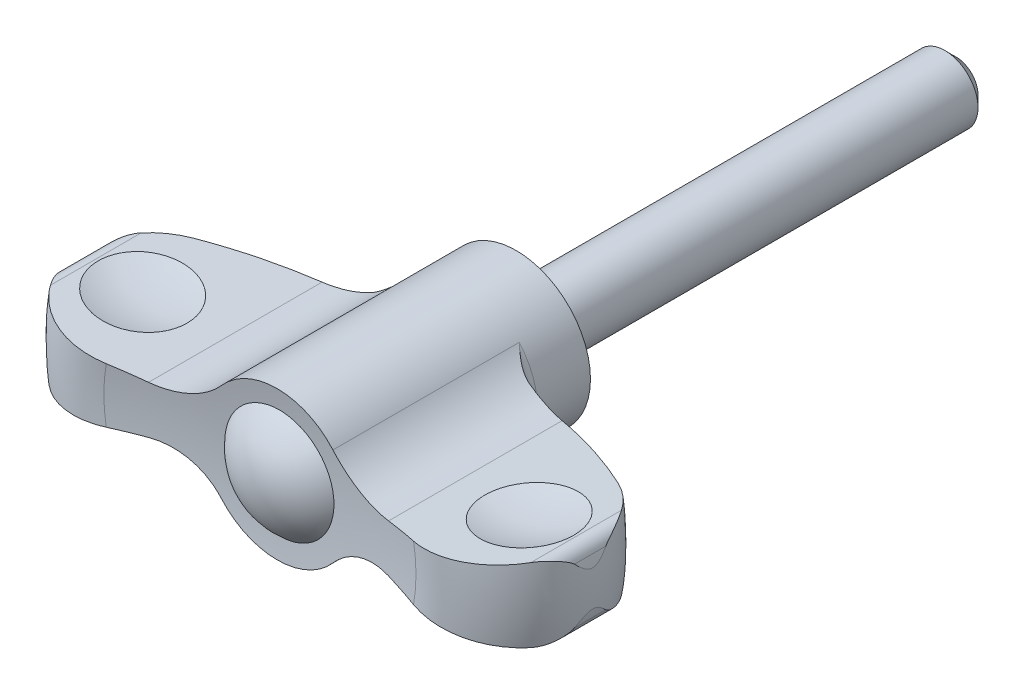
ISO-10303-21;
HEADER;
FILE_DESCRIPTION(('STEP AP214'),'2;1');
FILE_NAME('part.step','',(''),(''),'','','');
FILE_SCHEMA(('AUTOMOTIVE_DESIGN { 1 0 10303 214 1 1 1 1 }'));
ENDSEC;
DATA;
#1=APPLICATION_CONTEXT('core data for automotive mechanical design processes');
#2=APPLICATION_PROTOCOL_DEFINITION('international standard','automotive_design',2000,#1);
#3=PRODUCT_CONTEXT('',#1,'mechanical');
#4=PRODUCT('Part','Part','',(#3));
#5=PRODUCT_RELATED_PRODUCT_CATEGORY('part','',(#4));
#6=PRODUCT_DEFINITION_FORMATION('','',#4);
#7=PRODUCT_DEFINITION_CONTEXT('part definition',#1,'design');
#8=PRODUCT_DEFINITION('design','',#6,#7);
#9=PRODUCT_DEFINITION_SHAPE('','',#8);
#10=(LENGTH_UNIT() NAMED_UNIT(*) SI_UNIT(.MILLI.,.METRE.));
#11=(NAMED_UNIT(*) PLANE_ANGLE_UNIT() SI_UNIT($,.RADIAN.));
#12=(NAMED_UNIT(*) SI_UNIT($,.STERADIAN.) SOLID_ANGLE_UNIT());
#13=UNCERTAINTY_MEASURE_WITH_UNIT(LENGTH_MEASURE(1.E-05),#10,'distance_accuracy_value','');
#14=(GEOMETRIC_REPRESENTATION_CONTEXT(3) GLOBAL_UNCERTAINTY_ASSIGNED_CONTEXT((#13)) GLOBAL_UNIT_ASSIGNED_CONTEXT((#10,
#11,#12)) REPRESENTATION_CONTEXT('',''));
#15=CARTESIAN_POINT('',(0.,0.,0.));
#16=DIRECTION('',(0.,0.,1.));
#17=DIRECTION('',(1.,0.,0.));
#18=AXIS2_PLACEMENT_3D('',#15,#16,#17);
#19=CARTESIAN_POINT('',(0.,0.,72.3));
#20=DIRECTION('',(0.,0.,-1.));
#21=DIRECTION('',(1.,0.,0.));
#22=AXIS2_PLACEMENT_3D('',#19,#20,#21);
#23=SPHERICAL_SURFACE('',#22,51.);
#24=CARTESIAN_POINT('',(0.106101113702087,-0.984705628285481,72.3));
#25=DIRECTION('',(-0.107128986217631,0.994245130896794,0.));
#26=DIRECTION('',(-0.994245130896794,-0.107128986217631,0.));
#27=AXIS2_PLACEMENT_3D('',#24,#25,#26);
#28=CIRCLE('',#27,50.9903824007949);
#29=CARTESIAN_POINT('',(-13.9736878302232,-2.50178976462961,23.3155422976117));
#30=VERTEX_POINT('',#29);
#31=CARTESIAN_POINT('',(-10.91666942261,-2.17239888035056,22.529456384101));
#32=VERTEX_POINT('',#31);
#33=EDGE_CURVE('E30',#30,#32,#28,.F.);
#34=ORIENTED_EDGE('',*,*,#33,.T.);
#35=CARTESIAN_POINT('',(-10.91686942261,-2.17242043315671,22.5295011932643));
#36=CARTESIAN_POINT('',(-10.7296469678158,-2.15222267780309,22.4875506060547));
#37=CARTESIAN_POINT('',(-10.5413017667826,-2.13980901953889,22.4468208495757));
#38=CARTESIAN_POINT('',(-10.1636425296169,-2.13069190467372,22.3680695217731));
#39=CARTESIAN_POINT('',(-9.97432836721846,-2.13399055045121,22.3300483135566));
#40=CARTESIAN_POINT('',(-9.59601268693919,-2.15644826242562,22.2569830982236));
#41=CARTESIAN_POINT('',(-9.40701125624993,-2.17561118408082,22.2219398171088));
#42=CARTESIAN_POINT('',(-9.03072706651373,-2.22980411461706,22.1550981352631));
#43=CARTESIAN_POINT('',(-8.84344419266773,-2.26483305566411,22.1232995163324));
#44=CARTESIAN_POINT('',(-8.47162022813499,-2.35072423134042,22.063129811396));
#45=CARTESIAN_POINT('',(-8.2870846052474,-2.40161451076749,22.034764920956));
#46=CARTESIAN_POINT('',(-7.92248584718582,-2.51896555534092,21.9817487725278));
#47=CARTESIAN_POINT('',(-7.7424225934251,-2.5854259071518,21.9570974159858));
#48=CARTESIAN_POINT('',(-7.38832723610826,-2.7334638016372,21.9117265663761));
#49=CARTESIAN_POINT('',(-7.21428915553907,-2.81502582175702,21.8910030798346));
#50=CARTESIAN_POINT('',(-6.87341920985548,-2.99279306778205,21.8536266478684));
#51=CARTESIAN_POINT('',(-6.70658636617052,-3.08899629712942,21.836973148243));
#52=CARTESIAN_POINT('',(-6.40782206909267,-3.27863643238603,21.8102333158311));
#53=CARTESIAN_POINT('',(-6.27461901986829,-3.36999069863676,21.7995199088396));
#54=CARTESIAN_POINT('',(-6.01493123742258,-3.56204909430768,21.7811068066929));
#55=CARTESIAN_POINT('',(-5.88844563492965,-3.66275200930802,21.7734067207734));
#56=CARTESIAN_POINT('',(-5.64271699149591,-3.87314316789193,21.7610572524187));
#57=CARTESIAN_POINT('',(-5.52348434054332,-3.98284379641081,21.7564121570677));
#58=CARTESIAN_POINT('',(-5.29308424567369,-4.2105332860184,21.7502131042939));
#59=CARTESIAN_POINT('',(-5.18191832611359,-4.32852370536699,21.7486597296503));
#60=CARTESIAN_POINT('',(-5.07512339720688,-4.4503508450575,21.7486647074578));
#61=B_SPLINE_CURVE_WITH_KNOTS('',3,(#35,#36,#37,#38,#39,#40,#41,#42,#43,#44,#45,#46,#47,#48,#49,
#50,#51,#52,#53,#54,#55,#56,#57,#58,#59,#60),.UNSPECIFIED.,.F.,.F.,(4,2,2,2,2,2,2,2,2,2,2,2,4),
(0.,0.578626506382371,1.15733043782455,1.73617505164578,2.31498071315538,2.89481563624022,
3.47463516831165,4.05386199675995,4.63300990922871,5.1182130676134,5.60335328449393,
6.08917285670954,6.57508399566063),.UNSPECIFIED.);
#62=CARTESIAN_POINT('',(-5.07529875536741,-4.4501508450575,21.7486647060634));
#63=VERTEX_POINT('',#62);
#64=EDGE_CURVE('E34',#32,#63,#61,.T.);
#65=ORIENTED_EDGE('',*,*,#64,.T.);
#66=CARTESIAN_POINT('',(0.,0.,21.7486647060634));
#67=DIRECTION('',(0.,0.,1.));
#68=DIRECTION('',(1.,0.,0.));
#69=AXIS2_PLACEMENT_3D('',#66,#67,#68);
#70=CIRCLE('',#69,6.75);
#71=CARTESIAN_POINT('',(5.07529875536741,-4.4501508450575,21.7486647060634));
#72=VERTEX_POINT('',#71);
#73=EDGE_CURVE('E350',#63,#72,#70,.T.);
#74=ORIENTED_EDGE('',*,*,#73,.T.);
#75=CARTESIAN_POINT('',(5.07512339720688,-4.4503508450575,21.7486647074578));
#76=CARTESIAN_POINT('',(5.19811151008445,-4.31003841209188,21.7486568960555));
#77=CARTESIAN_POINT('',(5.32690563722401,-4.1748233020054,21.750718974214));
#78=CARTESIAN_POINT('',(5.59507822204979,-3.91549700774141,21.7589403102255));
#79=CARTESIAN_POINT('',(5.73445549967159,-3.79138458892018,21.7650991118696));
#80=CARTESIAN_POINT('',(6.0224023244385,-3.55546265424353,21.7814490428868));
#81=CARTESIAN_POINT('',(6.17094583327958,-3.44362058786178,21.7916291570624));
#82=CARTESIAN_POINT('',(6.47646460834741,-3.23260452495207,21.8159402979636));
#83=CARTESIAN_POINT('',(6.63343982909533,-3.13343046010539,21.8300713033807));
#84=CARTESIAN_POINT('',(6.9547027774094,-2.94837494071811,21.8621786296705));
#85=CARTESIAN_POINT('',(7.11899194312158,-2.86249611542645,21.8801557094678));
#86=CARTESIAN_POINT('',(7.45373433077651,-2.70454154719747,21.9198257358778));
#87=CARTESIAN_POINT('',(7.62419031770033,-2.63247208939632,21.9415203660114));
#88=CARTESIAN_POINT('',(7.9700647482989,-2.50255377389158,21.9884706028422));
#89=CARTESIAN_POINT('',(8.14548582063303,-2.44471261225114,22.013728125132));
#90=CARTESIAN_POINT('',(8.49988931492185,-2.34360925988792,22.0675996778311));
#91=CARTESIAN_POINT('',(8.67887012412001,-2.30034061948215,22.0962122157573));
#92=CARTESIAN_POINT('',(9.02900148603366,-2.2305564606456,22.1548846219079));
#93=CARTESIAN_POINT('',(9.20002034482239,-2.20322989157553,22.1847703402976));
#94=CARTESIAN_POINT('',(9.54316942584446,-2.1617212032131,22.2471706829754));
#95=CARTESIAN_POINT('',(9.7152996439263,-2.14753903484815,22.2796852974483));
#96=CARTESIAN_POINT('',(10.0596012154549,-2.13229985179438,22.3471369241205));
#97=CARTESIAN_POINT('',(10.2317725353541,-2.13123840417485,22.382073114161));
#98=CARTESIAN_POINT('',(10.5752280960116,-2.14211213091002,22.4541699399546));
#99=CARTESIAN_POINT('',(10.746512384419,-2.154046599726,22.4913304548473));
#100=CARTESIAN_POINT('',(10.91686942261,-2.17242043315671,22.5295011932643));
#101=B_SPLINE_CURVE_WITH_KNOTS('',3,(#75,#76,#77,#78,#79,#80,#81,#82,#83,#84,#85,#86,#87,#88,
#89,#90,#91,#92,#93,#94,#95,#96,#97,#98,#99,#100),.UNSPECIFIED.,.F.,.F.,(4,2,2,2,2,2,2,2,2,2,2,
2,4),(0.,0.559574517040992,1.11908673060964,1.67707683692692,2.2350639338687,2.79316123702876,
3.35151194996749,3.91016401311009,4.46856849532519,4.99529953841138,5.52202861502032,
6.04857972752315,6.57510225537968),.UNSPECIFIED.);
#102=CARTESIAN_POINT('',(10.91666942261,-2.17239888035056,22.529456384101));
#103=VERTEX_POINT('',#102);
#104=EDGE_CURVE('E343',#72,#103,#101,.T.);
#105=ORIENTED_EDGE('',*,*,#104,.T.);
#106=CARTESIAN_POINT('',(-0.10610111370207,-0.984705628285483,72.3));
#107=DIRECTION('',(0.107128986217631,0.994245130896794,0.));
#108=DIRECTION('',(-0.994245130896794,0.107128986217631,0.));
#109=AXIS2_PLACEMENT_3D('',#106,#107,#108);
#110=CIRCLE('',#109,50.9903824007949);
#111=CARTESIAN_POINT('',(13.9736878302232,-2.50178976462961,23.3155422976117));
#112=VERTEX_POINT('',#111);
#113=EDGE_CURVE('E351',#103,#112,#110,.F.);
#114=ORIENTED_EDGE('',*,*,#113,.T.);
#115=CARTESIAN_POINT('',(0.,0.,23.3155422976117));
#116=DIRECTION('',(0.,0.,-1.));
#117=DIRECTION('',(-1.,0.,0.));
#118=AXIS2_PLACEMENT_3D('',#115,#116,#117);
#119=CIRCLE('',#118,14.1958762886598);
#120=CARTESIAN_POINT('',(13.9736878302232,2.50178976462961,23.3155422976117));
#121=VERTEX_POINT('',#120);
#122=EDGE_CURVE('E186',#121,#112,#119,.T.);
#123=ORIENTED_EDGE('',*,*,#122,.F.);
#124=CARTESIAN_POINT('',(-0.10610111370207,0.984705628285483,72.3));
#125=DIRECTION('',(0.107128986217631,-0.994245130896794,0.));
#126=DIRECTION('',(0.994245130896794,0.107128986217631,0.));
#127=AXIS2_PLACEMENT_3D('',#124,#125,#126);
#128=CIRCLE('',#127,50.9903824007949);
#129=CARTESIAN_POINT('',(10.91666942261,2.17239888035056,22.529456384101));
#130=VERTEX_POINT('',#129);
#131=EDGE_CURVE('E370',#121,#130,#128,.F.);
#132=ORIENTED_EDGE('',*,*,#131,.T.);
#133=CARTESIAN_POINT('',(10.91686942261,2.17242043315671,22.5295011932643));
#134=CARTESIAN_POINT('',(10.7296469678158,2.15222267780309,22.4875506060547));
#135=CARTESIAN_POINT('',(10.5413017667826,2.13980901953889,22.4468208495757));
#136=CARTESIAN_POINT('',(10.1636425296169,2.13069190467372,22.3680695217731));
#137=CARTESIAN_POINT('',(9.97432836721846,2.13399055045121,22.3300483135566));
#138=CARTESIAN_POINT('',(9.59601268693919,2.15644826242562,22.2569830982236));
#139=CARTESIAN_POINT('',(9.40701125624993,2.17561118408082,22.2219398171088));
#140=CARTESIAN_POINT('',(9.03072706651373,2.22980411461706,22.1550981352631));
#141=CARTESIAN_POINT('',(8.84344419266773,2.26483305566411,22.1232995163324));
#142=CARTESIAN_POINT('',(8.47162022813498,2.35072423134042,22.063129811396));
#143=CARTESIAN_POINT('',(8.2870846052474,2.40161451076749,22.034764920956));
#144=CARTESIAN_POINT('',(7.92248584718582,2.51896555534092,21.9817487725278));
#145=CARTESIAN_POINT('',(7.7424225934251,2.5854259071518,21.9570974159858));
#146=CARTESIAN_POINT('',(7.38832723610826,2.7334638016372,21.9117265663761));
#147=CARTESIAN_POINT('',(7.21428915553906,2.81502582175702,21.8910030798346));
#148=CARTESIAN_POINT('',(6.87341920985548,2.99279306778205,21.8536266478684));
#149=CARTESIAN_POINT('',(6.70658636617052,3.08899629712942,21.836973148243));
#150=CARTESIAN_POINT('',(6.40782206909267,3.27863643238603,21.8102333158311));
#151=CARTESIAN_POINT('',(6.27461901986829,3.36999069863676,21.7995199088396));
#152=CARTESIAN_POINT('',(6.01493123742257,3.56204909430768,21.7811068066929));
#153=CARTESIAN_POINT('',(5.88844563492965,3.66275200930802,21.7734067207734));
#154=CARTESIAN_POINT('',(5.64271699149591,3.87314316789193,21.7610572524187));
#155=CARTESIAN_POINT('',(5.52348434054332,3.98284379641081,21.7564121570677));
#156=CARTESIAN_POINT('',(5.29308424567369,4.2105332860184,21.7502131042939));
#157=CARTESIAN_POINT('',(5.18191832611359,4.32852370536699,21.7486597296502));
#158=CARTESIAN_POINT('',(5.07512339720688,4.4503508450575,21.7486647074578));
#159=B_SPLINE_CURVE_WITH_KNOTS('',3,(#133,#134,#135,#136,#137,#138,#139,#140,#141,#142,#143,
#144,#145,#146,#147,#148,#149,#150,#151,#152,#153,#154,#155,#156,#157,#158),.UNSPECIFIED.,.F.,
.F.,(4,2,2,2,2,2,2,2,2,2,2,2,4),(0.,0.578626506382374,1.15733043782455,1.73617505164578,
2.31498071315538,2.89481563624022,3.47463516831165,4.05386199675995,4.63300990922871,
5.1182130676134,5.60335328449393,6.08917285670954,6.57508399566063),.UNSPECIFIED.);
#160=CARTESIAN_POINT('',(5.07529875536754,4.45015084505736,21.7486647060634));
#161=VERTEX_POINT('',#160);
#162=EDGE_CURVE('E320',#130,#161,#159,.T.);
#163=ORIENTED_EDGE('',*,*,#162,.T.);
#164=CARTESIAN_POINT('',(0.,0.,21.7486647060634));
#165=DIRECTION('',(0.,0.,1.));
#166=DIRECTION('',(1.,0.,0.));
#167=AXIS2_PLACEMENT_3D('',#164,#165,#166);
#168=CIRCLE('',#167,6.75);
#169=CARTESIAN_POINT('',(-5.07529875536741,4.4501508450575,21.7486647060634));
#170=VERTEX_POINT('',#169);
#171=EDGE_CURVE('E326',#161,#170,#168,.T.);
#172=ORIENTED_EDGE('',*,*,#171,.T.);
#173=CARTESIAN_POINT('',(-5.07512339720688,4.4503508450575,21.7486647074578));
#174=CARTESIAN_POINT('',(-5.19811151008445,4.31003841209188,21.7486568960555));
#175=CARTESIAN_POINT('',(-5.32690563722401,4.1748233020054,21.750718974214));
#176=CARTESIAN_POINT('',(-5.59507822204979,3.91549700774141,21.7589403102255));
#177=CARTESIAN_POINT('',(-5.73445549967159,3.79138458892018,21.7650991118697));
#178=CARTESIAN_POINT('',(-6.0224023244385,3.55546265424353,21.7814490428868));
#179=CARTESIAN_POINT('',(-6.17094583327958,3.44362058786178,21.7916291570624));
#180=CARTESIAN_POINT('',(-6.47646460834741,3.23260452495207,21.8159402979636));
#181=CARTESIAN_POINT('',(-6.63343982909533,3.13343046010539,21.8300713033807));
#182=CARTESIAN_POINT('',(-6.9547027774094,2.94837494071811,21.8621786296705));
#183=CARTESIAN_POINT('',(-7.11899194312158,2.86249611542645,21.8801557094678));
#184=CARTESIAN_POINT('',(-7.45373433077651,2.70454154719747,21.9198257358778));
#185=CARTESIAN_POINT('',(-7.62419031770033,2.63247208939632,21.9415203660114));
#186=CARTESIAN_POINT('',(-7.9700647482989,2.50255377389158,21.9884706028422));
#187=CARTESIAN_POINT('',(-8.14548582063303,2.44471261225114,22.013728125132));
#188=CARTESIAN_POINT('',(-8.49988931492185,2.34360925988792,22.0675996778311));
#189=CARTESIAN_POINT('',(-8.67887012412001,2.30034061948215,22.0962122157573));
#190=CARTESIAN_POINT('',(-9.02900148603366,2.2305564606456,22.1548846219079));
#191=CARTESIAN_POINT('',(-9.20002034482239,2.20322989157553,22.1847703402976));
#192=CARTESIAN_POINT('',(-9.54316942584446,2.1617212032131,22.2471706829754));
#193=CARTESIAN_POINT('',(-9.7152996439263,2.14753903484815,22.2796852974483));
#194=CARTESIAN_POINT('',(-10.0596012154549,2.13229985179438,22.3471369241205));
#195=CARTESIAN_POINT('',(-10.2317725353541,2.13123840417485,22.382073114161));
#196=CARTESIAN_POINT('',(-10.5752280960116,2.14211213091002,22.4541699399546));
#197=CARTESIAN_POINT('',(-10.746512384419,2.154046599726,22.4913304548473));
#198=CARTESIAN_POINT('',(-10.91686942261,2.17242043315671,22.5295011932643));
#199=B_SPLINE_CURVE_WITH_KNOTS('',3,(#173,#174,#175,#176,#177,#178,#179,#180,#181,#182,#183,
#184,#185,#186,#187,#188,#189,#190,#191,#192,#193,#194,#195,#196,#197,#198),.UNSPECIFIED.,.F.,
.F.,(4,2,2,2,2,2,2,2,2,2,2,2,4),(0.,0.559574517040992,1.11908673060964,1.67707683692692,
2.2350639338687,2.79316123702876,3.35151194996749,3.91016401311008,4.46856849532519,
4.99529953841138,5.52202861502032,6.04857972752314,6.57510225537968),.UNSPECIFIED.);
#200=CARTESIAN_POINT('',(-10.91666942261,2.17239888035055,22.529456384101));
#201=VERTEX_POINT('',#200);
#202=EDGE_CURVE('E191',#170,#201,#199,.T.);
#203=ORIENTED_EDGE('',*,*,#202,.T.);
#204=CARTESIAN_POINT('',(0.106101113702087,0.984705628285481,72.3));
#205=DIRECTION('',(-0.107128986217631,-0.994245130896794,0.));
#206=DIRECTION('',(0.994245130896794,-0.107128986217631,0.));
#207=AXIS2_PLACEMENT_3D('',#204,#205,#206);
#208=CIRCLE('',#207,50.9903824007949);
#209=CARTESIAN_POINT('',(-13.9736878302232,2.50178976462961,23.3155422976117));
#210=VERTEX_POINT('',#209);
#211=EDGE_CURVE('E446',#201,#210,#208,.F.);
#212=ORIENTED_EDGE('',*,*,#211,.T.);
#213=EDGE_CURVE('E495',#30,#210,#119,.T.);
#214=ORIENTED_EDGE('',*,*,#213,.F.);
#215=EDGE_LOOP('',(#34,#65,#74,#105,#114,#123,#132,#163,#172,#203,#212,#214));
#216=FACE_BOUND('',#215,.T.);
#217=CARTESIAN_POINT('',(0.,0.,21.5419708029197));
#218=DIRECTION('',(0.,0.,-1.));
#219=DIRECTION('',(-1.,0.,0.));
#220=AXIS2_PLACEMENT_3D('',#217,#218,#219);
#221=CIRCLE('',#220,4.96210358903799);
#222=CARTESIAN_POINT('',(-4.96210358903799,0.,21.5419708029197));
#223=VERTEX_POINT('',#222);
#224=EDGE_CURVE('E383',#223,#223,#221,.T.);
#225=ORIENTED_EDGE('',*,*,#224,.T.);
#226=EDGE_LOOP('',(#225));
#227=FACE_BOUND('',#226,.T.);
#228=ADVANCED_FACE('F14',(#216,#227),#23,.F.);
#229=CARTESIAN_POINT('',(-10.91666942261,-2.17239888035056,24.));
#230=DIRECTION('',(-0.107128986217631,0.994245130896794,0.));
#231=DIRECTION('',(-0.994245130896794,-0.107128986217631,0.));
#232=AXIS2_PLACEMENT_3D('',#229,#230,#231);
#233=PLANE('',#232);
#234=ORIENTED_EDGE('',*,*,#33,.F.);
#235=CARTESIAN_POINT('',(-21.8457309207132,-3.34999507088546,20.5252646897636));
#236=CARTESIAN_POINT('',(-21.7302435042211,-3.33755140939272,20.6912978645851));
#237=CARTESIAN_POINT('',(-21.6077536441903,-3.32435324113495,20.8523984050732));
#238=CARTESIAN_POINT('',(-21.3497248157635,-3.29655087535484,21.1636425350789));
#239=CARTESIAN_POINT('',(-21.2141865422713,-3.28194675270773,21.3137867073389));
#240=CARTESIAN_POINT('',(-20.9311105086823,-3.25144557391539,21.6019360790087));
#241=CARTESIAN_POINT('',(-20.783581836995,-3.23554949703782,21.7399503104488));
#242=CARTESIAN_POINT('',(-20.4774952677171,-3.20256895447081,22.0029918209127));
#243=CARTESIAN_POINT('',(-20.3189374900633,-3.18548450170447,22.1280192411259));
#244=CARTESIAN_POINT('',(-19.9918782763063,-3.15024417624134,22.3642331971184));
#245=CARTESIAN_POINT('',(-19.8233743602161,-3.13208803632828,22.4754162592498));
#246=CARTESIAN_POINT('',(-19.4775952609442,-3.09483066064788,22.6831586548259));
#247=CARTESIAN_POINT('',(-19.3003168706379,-3.07572907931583,22.7797125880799));
#248=CARTESIAN_POINT('',(-18.9383738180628,-3.0367300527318,22.9574348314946));
#249=CARTESIAN_POINT('',(-18.7537118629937,-3.01683289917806,23.0386087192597));
#250=CARTESIAN_POINT('',(-18.3782492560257,-2.97637715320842,23.1850463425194));
#251=CARTESIAN_POINT('',(-18.1874484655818,-2.95581854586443,23.2503097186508));
#252=CARTESIAN_POINT('',(-17.8008818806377,-2.91416635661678,23.3645224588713));
#253=CARTESIAN_POINT('',(-17.6051115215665,-2.89307228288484,23.4134561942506));
#254=CARTESIAN_POINT('',(-17.2101714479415,-2.85051785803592,23.4945837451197));
#255=CARTESIAN_POINT('',(-17.011001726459,-2.82905750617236,23.5267775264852));
#256=CARTESIAN_POINT('',(-16.6106619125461,-2.78592126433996,23.5742057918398));
#257=CARTESIAN_POINT('',(-16.4094916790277,-2.76424535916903,23.589439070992));
#258=CARTESIAN_POINT('',(-16.006594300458,-2.72083354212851,23.6028415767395));
#259=CARTESIAN_POINT('',(-15.804867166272,-2.69909763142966,23.6010111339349));
#260=CARTESIAN_POINT('',(-15.4019677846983,-2.65568559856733,23.5802910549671));
#261=CARTESIAN_POINT('',(-15.2007968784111,-2.63400962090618,23.5613750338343));
#262=CARTESIAN_POINT('',(-14.8008192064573,-2.59091239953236,23.5065973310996));
#263=CARTESIAN_POINT('',(-14.6020116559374,-2.56949107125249,23.47074144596));
#264=CARTESIAN_POINT('',(-14.2079744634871,-2.52703393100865,23.3823184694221));
#265=CARTESIAN_POINT('',(-14.0127471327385,-2.50599836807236,23.3297409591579));
#266=CARTESIAN_POINT('',(-13.6273876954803,-2.46447624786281,23.208260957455));
#267=CARTESIAN_POINT('',(-13.4372553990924,-2.44398967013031,23.1393590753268));
#268=CARTESIAN_POINT('',(-13.0629639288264,-2.40366011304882,22.985531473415));
#269=CARTESIAN_POINT('',(-12.8788206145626,-2.38381884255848,22.9005667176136));
#270=CARTESIAN_POINT('',(-12.5183119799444,-2.34497437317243,22.7153302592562));
#271=CARTESIAN_POINT('',(-12.3419464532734,-2.3259711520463,22.6150589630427));
#272=CARTESIAN_POINT('',(-11.9985630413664,-2.28897190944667,22.400122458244));
#273=CARTESIAN_POINT('',(-11.8315288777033,-2.27097413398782,22.2854835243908));
#274=CARTESIAN_POINT('',(-11.5077189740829,-2.23608391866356,22.0425218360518));
#275=CARTESIAN_POINT('',(-11.3509370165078,-2.21919080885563,21.9142075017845));
#276=CARTESIAN_POINT('',(-11.1514082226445,-2.19769176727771,21.7363546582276));
#277=CARTESIAN_POINT('',(-11.1035524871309,-2.19253535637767,21.6925222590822));
#278=CARTESIAN_POINT('',(-11.0090859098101,-2.18235667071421,21.6036210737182));
#279=CARTESIAN_POINT('',(-10.9624737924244,-2.17733425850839,21.5585536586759));
#280=CARTESIAN_POINT('',(-10.91646942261,-2.17237733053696,21.5128574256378));
#281=B_SPLINE_CURVE_WITH_KNOTS('',3,(#235,#236,#237,#238,#239,#240,#241,#242,#243,#244,#245,
#246,#247,#248,#249,#250,#251,#252,#253,#254,#255,#256,#257,#258,#259,#260,#261,#262,#263,#264,
#265,#266,#267,#268,#269,#270,#271,#272,#273,#274,#275,#276,#277,#278,#279,#280),.UNSPECIFIED.,
.F.,.F.,(4,2,2,2,2,2,2,2,2,2,2,2,2,2,2,2,2,2,2,2,2,2,4),(0.,0.607705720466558,1.21537909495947,
1.82259608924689,2.42980648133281,3.03716892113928,3.64475501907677,4.25212035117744,
4.85949940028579,5.46745810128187,6.07541804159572,6.68342116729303,7.29141251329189,
7.90034437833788,8.50906803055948,9.11817171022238,9.72725265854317,10.3378332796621,
10.9483976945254,11.557861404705,12.166952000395,12.3622359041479,12.5573111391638),.UNSPECIFIED.);
#282=CARTESIAN_POINT('',(-21.8455309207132,-3.34997352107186,20.5255521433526));
#283=VERTEX_POINT('',#282);
#284=EDGE_CURVE('E904',#283,#30,#281,.T.);
#285=ORIENTED_EDGE('',*,*,#284,.F.);
#286=DIRECTION('',(0.,0.,-1.));
#287=VECTOR('',#286,1.);
#288=CARTESIAN_POINT('',(-21.8455309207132,-3.34997352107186,24.));
#289=LINE('',#288,#287);
#290=CARTESIAN_POINT('',(-21.8455309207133,-3.34997352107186,12.2746267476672));
#291=VERTEX_POINT('',#290);
#292=EDGE_CURVE('E465',#283,#291,#289,.T.);
#293=ORIENTED_EDGE('',*,*,#292,.T.);
#294=CARTESIAN_POINT('',(-19.2945778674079,-3.07511070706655,10.0206583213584));
#295=CARTESIAN_POINT('',(-19.4747975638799,-3.09452921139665,10.1153575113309));
#296=CARTESIAN_POINT('',(-19.6509896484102,-3.11351374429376,10.2178086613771));
#297=CARTESIAN_POINT('',(-19.9941575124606,-3.15048976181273,10.4374340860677));
#298=CARTESIAN_POINT('',(-20.1611295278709,-3.16848084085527,10.55461431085));
#299=CARTESIAN_POINT('',(-20.4813600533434,-3.20298538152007,10.8003921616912));
#300=CARTESIAN_POINT('',(-20.6348240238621,-3.21952098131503,10.9287191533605));
#301=CARTESIAN_POINT('',(-20.9305024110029,-3.25138005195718,11.1977390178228));
#302=CARTESIAN_POINT('',(-21.0727226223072,-3.26670414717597,11.3384254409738));
#303=CARTESIAN_POINT('',(-21.3235946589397,-3.29373537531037,11.608219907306));
#304=CARTESIAN_POINT('',(-21.43401009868,-3.3056325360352,11.7356749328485));
#305=CARTESIAN_POINT('',(-21.6465578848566,-3.32853436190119,11.9991858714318));
#306=CARTESIAN_POINT('',(-21.7486121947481,-3.33953061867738,12.135305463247));
#307=CARTESIAN_POINT('',(-21.8457309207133,-3.34999507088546,12.2749142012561));
#308=B_SPLINE_CURVE_WITH_KNOTS('',3,(#294,#295,#296,#297,#298,#299,#300,#301,#302,#303,#304,
#305,#306,#307),.UNSPECIFIED.,.F.,.F.,(4,2,2,2,2,2,4),(0.,0.613344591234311,1.22693775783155,
1.82843414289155,2.42961848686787,2.93636077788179,3.44739305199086),.UNSPECIFIED.);
#309=CARTESIAN_POINT('',(-19.2949583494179,-3.07515170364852,10.0208583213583));
#310=VERTEX_POINT('',#309);
#311=EDGE_CURVE('E877',#310,#291,#308,.T.);
#312=ORIENTED_EDGE('',*,*,#311,.F.);
#313=CARTESIAN_POINT('',(-10.91646942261,-2.17237733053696,6.74022888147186));
#314=CARTESIAN_POINT('',(-11.6429801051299,-2.2506581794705,6.93529272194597));
#315=CARTESIAN_POINT('',(-12.3641189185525,-2.32836021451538,7.15058575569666));
#316=CARTESIAN_POINT('',(-13.791310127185,-2.48213873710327,7.62017172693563));
#317=CARTESIAN_POINT('',(-14.4974016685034,-2.558219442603,7.87434431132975));
#318=CARTESIAN_POINT('',(-15.8945921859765,-2.70876541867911,8.42142446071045));
#319=CARTESIAN_POINT('',(-16.5856911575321,-2.78323068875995,8.71433203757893));
#320=CARTESIAN_POINT('',(-17.9528888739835,-2.93054496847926,9.33891493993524));
#321=CARTESIAN_POINT('',(-18.6289355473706,-3.0033883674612,9.67070557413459));
#322=CARTESIAN_POINT('',(-19.2953387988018,-3.07519269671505,10.0210583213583));
#323=B_SPLINE_CURVE_WITH_KNOTS('',3,(#313,#314,#315,#316,#317,#318,#319,#320,#321,#322),
.UNSPECIFIED.,.F.,.F.,(4,2,2,2,4),(0.,2.26861905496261,4.53035255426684,6.79208674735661,
9.06070650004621),.UNSPECIFIED.);
#324=CARTESIAN_POINT('',(-10.91666942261,-2.17239888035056,6.74028258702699));
#325=VERTEX_POINT('',#324);
#326=EDGE_CURVE('E268',#325,#310,#323,.T.);
#327=ORIENTED_EDGE('',*,*,#326,.F.);
#328=DIRECTION('',(0.,0.,-1.));
#329=VECTOR('',#328,1.);
#330=CARTESIAN_POINT('',(-10.91666942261,-2.17239888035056,24.));
#331=LINE('',#330,#329);
#332=EDGE_CURVE('E462',#32,#325,#331,.T.);
#333=ORIENTED_EDGE('',*,*,#332,.F.);
#334=EDGE_LOOP('',(#234,#285,#293,#312,#327,#333));
#335=FACE_BOUND('',#334,.T.);
#336=CARTESIAN_POINT('',(-17.5815922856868,-2.89053810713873,16.4));
#337=DIRECTION('',(-0.107128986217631,0.994245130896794,0.));
#338=DIRECTION('',(-0.994245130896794,-0.107128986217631,0.));
#339=AXIS2_PLACEMENT_3D('',#336,#337,#338);
#340=CIRCLE('',#339,4.06502356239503);
#341=CARTESIAN_POINT('',(-21.6232221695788,-3.3260199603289,16.4));
#342=VERTEX_POINT('',#341);
#343=EDGE_CURVE('E380',#342,#342,#340,.F.);
#344=ORIENTED_EDGE('',*,*,#343,.F.);
#345=EDGE_LOOP('',(#344));
#346=FACE_BOUND('',#345,.T.);
#347=ADVANCED_FACE('F292',(#335,#346),#233,.F.);
#348=CARTESIAN_POINT('',(-10.91666942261,2.17239888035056,24.));
#349=DIRECTION('',(-0.107128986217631,-0.994245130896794,0.));
#350=DIRECTION('',(0.994245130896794,-0.107128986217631,0.));
#351=AXIS2_PLACEMENT_3D('',#348,#349,#350);
#352=PLANE('',#351);
#353=ORIENTED_EDGE('',*,*,#211,.F.);
#354=DIRECTION('',(0.,0.,-1.));
#355=VECTOR('',#354,1.);
#356=CARTESIAN_POINT('',(-10.91666942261,2.17239888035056,24.));
#357=LINE('',#356,#355);
#358=CARTESIAN_POINT('',(-10.91666942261,2.17239888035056,6.74028258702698));
#359=VERTEX_POINT('',#358);
#360=EDGE_CURVE('E193',#201,#359,#357,.T.);
#361=ORIENTED_EDGE('',*,*,#360,.T.);
#362=CARTESIAN_POINT('',(-19.2953387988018,3.07519269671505,10.0210583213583));
#363=CARTESIAN_POINT('',(-18.6289355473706,3.0033883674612,9.67070557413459));
#364=CARTESIAN_POINT('',(-17.9528888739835,2.93054496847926,9.33891493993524));
#365=CARTESIAN_POINT('',(-16.5856911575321,2.78323068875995,8.71433203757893));
#366=CARTESIAN_POINT('',(-15.8945921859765,2.70876541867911,8.42142446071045));
#367=CARTESIAN_POINT('',(-14.4974016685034,2.558219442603,7.87434431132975));
#368=CARTESIAN_POINT('',(-13.791310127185,2.48213873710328,7.62017172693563));
#369=CARTESIAN_POINT('',(-12.3641189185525,2.32836021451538,7.15058575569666));
#370=CARTESIAN_POINT('',(-11.6429801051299,2.2506581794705,6.93529272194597));
#371=CARTESIAN_POINT('',(-10.91646942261,2.17237733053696,6.74022888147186));
#372=B_SPLINE_CURVE_WITH_KNOTS('',3,(#362,#363,#364,#365,#366,#367,#368,#369,#370,#371),
.UNSPECIFIED.,.F.,.F.,(4,2,2,2,4),(0.,2.2686197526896,4.53035394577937,6.7920874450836,
9.06070650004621),.UNSPECIFIED.);
#373=CARTESIAN_POINT('',(-19.2949583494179,3.07515170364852,10.0208583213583));
#374=VERTEX_POINT('',#373);
#375=EDGE_CURVE('E275',#374,#359,#372,.T.);
#376=ORIENTED_EDGE('',*,*,#375,.F.);
#377=CARTESIAN_POINT('',(-16.1316021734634,2.73430302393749,9.20190527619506));
#378=CARTESIAN_POINT('',(-16.3336188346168,2.75607013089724,9.20643915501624));
#379=CARTESIAN_POINT('',(-16.5354410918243,2.777816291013,9.2195877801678));
#380=CARTESIAN_POINT('',(-16.9372607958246,2.82111198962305,9.2629315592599));
#381=CARTESIAN_POINT('',(-17.1372583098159,2.84266153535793,9.29312608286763));
#382=CARTESIAN_POINT('',(-17.53371131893,2.88537897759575,9.37032135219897));
#383=CARTESIAN_POINT('',(-17.7301716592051,2.90654739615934,9.41729692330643));
#384=CARTESIAN_POINT('',(-18.1184556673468,2.94838463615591,9.52772695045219));
#385=CARTESIAN_POINT('',(-18.310279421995,2.9690534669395,9.59118109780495));
#386=CARTESIAN_POINT('',(-18.6875910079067,3.00970843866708,9.73399849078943));
#387=CARTESIAN_POINT('',(-18.8730894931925,3.02969572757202,9.81333326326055));
#388=CARTESIAN_POINT('',(-19.236871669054,3.0688929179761,9.98746420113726));
#389=CARTESIAN_POINT('',(-19.4151520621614,3.08810246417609,10.0822673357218));
#390=CARTESIAN_POINT('',(-19.7631321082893,3.12559698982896,10.2866372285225));
#391=CARTESIAN_POINT('',(-19.9328321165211,3.14388200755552,10.3962033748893));
#392=CARTESIAN_POINT('',(-20.2623750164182,3.17938994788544,10.6292750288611));
#393=CARTESIAN_POINT('',(-20.4222223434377,3.19661334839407,10.7527741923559));
#394=CARTESIAN_POINT('',(-20.7309200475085,3.22987523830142,11.0128081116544));
#395=CARTESIAN_POINT('',(-20.8797763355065,3.24591436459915,11.1493357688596));
#396=CARTESIAN_POINT('',(-21.1655301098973,3.27670406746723,11.4345171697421));
#397=CARTESIAN_POINT('',(-21.3024274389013,3.29145462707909,11.58317107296));
#398=CARTESIAN_POINT('',(-21.5634920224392,3.3195840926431,11.8918051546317));
#399=CARTESIAN_POINT('',(-21.6876381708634,3.33296072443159,12.0518033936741));
#400=CARTESIAN_POINT('',(-21.9220837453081,3.35822201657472,12.3817648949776));
#401=CARTESIAN_POINT('',(-22.0323824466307,3.37010659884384,12.5517286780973));
#402=CARTESIAN_POINT('',(-22.1353199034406,3.3811980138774,12.7260937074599));
#403=B_SPLINE_CURVE_WITH_KNOTS('',3,(#377,#378,#379,#380,#381,#382,#383,#384,#385,#386,#387,
#388,#389,#390,#391,#392,#393,#394,#395,#396,#397,#398,#399,#400,#401,#402),.UNSPECIFIED.,.F.,
.F.,(4,2,2,2,2,2,2,2,2,2,2,2,4),(0.,0.60952472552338,1.21902691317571,1.82761855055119,
2.43619878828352,3.04369749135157,3.65147065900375,4.25921864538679,4.86669101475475,
5.47383427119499,6.080985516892,6.68912606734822,7.29729843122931),.UNSPECIFIED.);
#404=CARTESIAN_POINT('',(-21.845530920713,3.34997352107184,12.2746267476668));
#405=VERTEX_POINT('',#404);
#406=EDGE_CURVE('E302',#405,#374,#403,.F.);
#407=ORIENTED_EDGE('',*,*,#406,.F.);
#408=DIRECTION('',(0.,0.,-1.));
#409=VECTOR('',#408,1.);
#410=CARTESIAN_POINT('',(-21.8455309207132,3.34997352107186,24.));
#411=LINE('',#410,#409);
#412=CARTESIAN_POINT('',(-21.8455309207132,3.34997352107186,20.5255521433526));
#413=VERTEX_POINT('',#412);
#414=EDGE_CURVE('E198',#413,#405,#411,.T.);
#415=ORIENTED_EDGE('',*,*,#414,.F.);
#416=CARTESIAN_POINT('',(-10.91646942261,2.17237733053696,21.5128574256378));
#417=CARTESIAN_POINT('',(-11.060414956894,2.18788732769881,21.6558705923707));
#418=CARTESIAN_POINT('',(-11.2103909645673,2.20404710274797,21.7927365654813));
#419=CARTESIAN_POINT('',(-11.5212615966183,2.23754312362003,22.0532734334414));
#420=CARTESIAN_POINT('',(-11.682155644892,2.25487930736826,22.1769450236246));
#421=CARTESIAN_POINT('',(-12.013622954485,2.29059460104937,22.4101285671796));
#422=CARTESIAN_POINT('',(-12.1841895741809,2.3089729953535,22.5196500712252));
#423=CARTESIAN_POINT('',(-12.5338820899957,2.3466520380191,22.723861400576));
#424=CARTESIAN_POINT('',(-12.7130078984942,2.36595267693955,22.8185513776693));
#425=CARTESIAN_POINT('',(-13.0785959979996,2.40534445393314,22.9924500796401));
#426=CARTESIAN_POINT('',(-13.2650601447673,2.42543579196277,23.0716548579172));
#427=CARTESIAN_POINT('',(-13.6440277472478,2.46626919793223,23.2140153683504));
#428=CARTESIAN_POINT('',(-13.8365334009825,2.48701150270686,23.2771651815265));
#429=CARTESIAN_POINT('',(-14.2260776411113,2.5289845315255,23.3869042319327));
#430=CARTESIAN_POINT('',(-14.4231144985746,2.55021506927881,23.433499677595));
#431=CARTESIAN_POINT('',(-14.8203952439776,2.59302169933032,23.5098273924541));
#432=CARTESIAN_POINT('',(-15.0206391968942,2.6145977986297,23.5395593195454));
#433=CARTESIAN_POINT('',(-15.4229162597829,2.65794277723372,23.581941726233));
#434=CARTESIAN_POINT('',(-15.6249494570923,2.67971166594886,23.5945913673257));
#435=CARTESIAN_POINT('',(-16.0293573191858,2.72328623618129,23.6027094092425));
#436=CARTESIAN_POINT('',(-16.2317319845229,2.74509191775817,23.5981777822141));
#437=CARTESIAN_POINT('',(-16.6353922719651,2.78858593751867,23.5719573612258));
#438=CARTESIAN_POINT('',(-16.8366778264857,2.81027426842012,23.5502675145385));
#439=CARTESIAN_POINT('',(-17.2367059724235,2.85337692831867,23.4898773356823));
#440=CARTESIAN_POINT('',(-17.4354486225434,2.87479126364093,23.451177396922));
#441=CARTESIAN_POINT('',(-17.8286809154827,2.91716167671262,23.3571066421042));
#442=CARTESIAN_POINT('',(-18.0231764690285,2.93811839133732,23.3017608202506));
#443=CARTESIAN_POINT('',(-18.4067663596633,2.97944984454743,23.1747874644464));
#444=CARTESIAN_POINT('',(-18.5958625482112,2.99982478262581,23.1031655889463));
#445=CARTESIAN_POINT('',(-18.9674894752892,3.03986723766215,22.9440840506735));
#446=CARTESIAN_POINT('',(-19.1500160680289,3.05953430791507,22.8566145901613));
#447=CARTESIAN_POINT('',(-19.5070671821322,3.09800623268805,22.6664899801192));
#448=CARTESIAN_POINT('',(-19.6815920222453,3.11681112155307,22.5638354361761));
#449=CARTESIAN_POINT('',(-20.0212685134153,3.15341094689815,22.3441502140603));
#450=CARTESIAN_POINT('',(-20.1864271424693,3.17120663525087,22.2271304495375));
#451=CARTESIAN_POINT('',(-20.5063289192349,3.20567575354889,21.9794851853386));
#452=CARTESIAN_POINT('',(-20.6610723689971,3.22234921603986,21.8488600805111));
#453=CARTESIAN_POINT('',(-20.9587578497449,3.25442454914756,21.5751939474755));
#454=CARTESIAN_POINT('',(-21.1017211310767,3.26982870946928,21.4321762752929));
#455=CARTESIAN_POINT('',(-21.3750859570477,3.29928351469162,21.1345878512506));
#456=CARTESIAN_POINT('',(-21.5054952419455,3.31333499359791,20.9800243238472));
#457=CARTESIAN_POINT('',(-21.6665115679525,3.33068435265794,20.7720063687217));
#458=CARTESIAN_POINT('',(-21.7032508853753,3.3346429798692,20.7232730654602));
#459=CARTESIAN_POINT('',(-21.7754460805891,3.34242194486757,20.6249310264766));
#460=CARTESIAN_POINT('',(-21.8109032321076,3.34624241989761,20.5753232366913));
#461=CARTESIAN_POINT('',(-21.8457309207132,3.34999507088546,20.5252646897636));
#462=B_SPLINE_CURVE_WITH_KNOTS('',3,(#416,#417,#418,#419,#420,#421,#422,#423,#424,#425,#426,
#427,#428,#429,#430,#431,#432,#433,#434,#435,#436,#437,#438,#439,#440,#441,#442,#443,#444,#445,
#446,#447,#448,#449,#450,#451,#452,#453,#454,#455,#456,#457,#458,#459,#460,#461),.UNSPECIFIED.,
.F.,.F.,(4,2,2,2,2,2,2,2,2,2,2,2,2,2,2,2,2,2,2,2,2,2,4),(0.,0.610322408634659,1.22061263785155,
1.83048877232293,2.44035866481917,3.05038378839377,3.66063348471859,4.27065407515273,
4.88068704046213,5.49074994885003,6.10081384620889,6.71091517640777,7.32100239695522,
7.93017809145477,8.5391423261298,9.14848434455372,9.75780206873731,10.3666597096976,
10.9754996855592,11.5832161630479,12.1905555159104,12.3740180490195,12.5572930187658),.UNSPECIFIED.);
#463=EDGE_CURVE('E308',#210,#413,#462,.T.);
#464=ORIENTED_EDGE('',*,*,#463,.F.);
#465=EDGE_LOOP('',(#353,#361,#376,#407,#415,#464));
#466=FACE_BOUND('',#465,.T.);
#467=CARTESIAN_POINT('',(-17.5815922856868,2.89053810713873,16.4));
#468=DIRECTION('',(-0.107128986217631,-0.994245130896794,0.));
#469=DIRECTION('',(0.994245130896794,-0.107128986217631,0.));
#470=AXIS2_PLACEMENT_3D('',#467,#468,#469);
#471=CIRCLE('',#470,4.06502356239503);
#472=CARTESIAN_POINT('',(-13.5399624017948,2.45505625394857,16.4));
#473=VERTEX_POINT('',#472);
#474=EDGE_CURVE('E377',#473,#473,#471,.F.);
#475=ORIENTED_EDGE('',*,*,#474,.F.);
#476=EDGE_LOOP('',(#475));
#477=FACE_BOUND('',#476,.T.);
#478=ADVANCED_FACE('F287',(#466,#477),#352,.F.);
#479=CARTESIAN_POINT('',(10.91666942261,-2.17239888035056,24.));
#480=DIRECTION('',(0.107128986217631,0.994245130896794,0.));
#481=DIRECTION('',(-0.994245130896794,0.107128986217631,0.));
#482=AXIS2_PLACEMENT_3D('',#479,#480,#481);
#483=PLANE('',#482);
#484=ORIENTED_EDGE('',*,*,#113,.F.);
#485=DIRECTION('',(0.,0.,-1.));
#486=VECTOR('',#485,1.);
#487=CARTESIAN_POINT('',(10.91666942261,-2.17239888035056,24.));
#488=LINE('',#487,#486);
#489=CARTESIAN_POINT('',(10.91666942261,-2.17239888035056,6.74028258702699));
#490=VERTEX_POINT('',#489);
#491=EDGE_CURVE('E441',#103,#490,#488,.T.);
#492=ORIENTED_EDGE('',*,*,#491,.T.);
#493=CARTESIAN_POINT('',(19.2953387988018,-3.07519269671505,10.0210583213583));
#494=CARTESIAN_POINT('',(18.6289355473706,-3.0033883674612,9.67070557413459));
#495=CARTESIAN_POINT('',(17.9528888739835,-2.93054496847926,9.33891493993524));
#496=CARTESIAN_POINT('',(16.5856911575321,-2.78323068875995,8.71433203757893));
#497=CARTESIAN_POINT('',(15.8945921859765,-2.70876541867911,8.42142446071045));
#498=CARTESIAN_POINT('',(14.4974016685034,-2.558219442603,7.87434431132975));
#499=CARTESIAN_POINT('',(13.791310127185,-2.48213873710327,7.62017172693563));
#500=CARTESIAN_POINT('',(12.3641189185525,-2.32836021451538,7.15058575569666));
#501=CARTESIAN_POINT('',(11.6429801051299,-2.2506581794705,6.93529272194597));
#502=CARTESIAN_POINT('',(10.91646942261,-2.17237733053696,6.74022888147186));
#503=B_SPLINE_CURVE_WITH_KNOTS('',3,(#493,#494,#495,#496,#497,#498,#499,#500,#501,#502),
.UNSPECIFIED.,.F.,.F.,(4,2,2,2,4),(0.,2.2686197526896,4.53035394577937,6.7920874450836,
9.06070650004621),.UNSPECIFIED.);
#504=CARTESIAN_POINT('',(19.2949583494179,-3.07515170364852,10.0208583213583));
#505=VERTEX_POINT('',#504);
#506=EDGE_CURVE('E245',#505,#490,#503,.T.);
#507=ORIENTED_EDGE('',*,*,#506,.F.);
#508=CARTESIAN_POINT('',(16.1316021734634,-2.73430302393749,9.20190527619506));
#509=CARTESIAN_POINT('',(16.3336188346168,-2.75607013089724,9.20643915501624));
#510=CARTESIAN_POINT('',(16.5354410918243,-2.777816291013,9.2195877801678));
#511=CARTESIAN_POINT('',(16.9372607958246,-2.82111198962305,9.2629315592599));
#512=CARTESIAN_POINT('',(17.1372583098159,-2.84266153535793,9.29312608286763));
#513=CARTESIAN_POINT('',(17.53371131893,-2.88537897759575,9.37032135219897));
#514=CARTESIAN_POINT('',(17.7301716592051,-2.90654739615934,9.41729692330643));
#515=CARTESIAN_POINT('',(18.1184556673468,-2.94838463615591,9.52772695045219));
#516=CARTESIAN_POINT('',(18.310279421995,-2.9690534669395,9.59118109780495));
#517=CARTESIAN_POINT('',(18.6875910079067,-3.00970843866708,9.73399849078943));
#518=CARTESIAN_POINT('',(18.8730894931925,-3.02969572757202,9.81333326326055));
#519=CARTESIAN_POINT('',(19.236871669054,-3.0688929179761,9.98746420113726));
#520=CARTESIAN_POINT('',(19.4151520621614,-3.08810246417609,10.0822673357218));
#521=CARTESIAN_POINT('',(19.7631321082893,-3.12559698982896,10.2866372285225));
#522=CARTESIAN_POINT('',(19.9328321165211,-3.14388200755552,10.3962033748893));
#523=CARTESIAN_POINT('',(20.2623750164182,-3.17938994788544,10.6292750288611));
#524=CARTESIAN_POINT('',(20.4222223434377,-3.19661334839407,10.7527741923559));
#525=CARTESIAN_POINT('',(20.7309200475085,-3.22987523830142,11.0128081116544));
#526=CARTESIAN_POINT('',(20.8797763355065,-3.24591436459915,11.1493357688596));
#527=CARTESIAN_POINT('',(21.1655301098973,-3.27670406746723,11.4345171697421));
#528=CARTESIAN_POINT('',(21.3024274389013,-3.29145462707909,11.58317107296));
#529=CARTESIAN_POINT('',(21.5634920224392,-3.3195840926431,11.8918051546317));
#530=CARTESIAN_POINT('',(21.6876381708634,-3.33296072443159,12.0518033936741));
#531=CARTESIAN_POINT('',(21.9220837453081,-3.35822201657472,12.3817648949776));
#532=CARTESIAN_POINT('',(22.0323824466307,-3.37010659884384,12.5517286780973));
#533=CARTESIAN_POINT('',(22.1353199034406,-3.3811980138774,12.7260937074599));
#534=B_SPLINE_CURVE_WITH_KNOTS('',3,(#508,#509,#510,#511,#512,#513,#514,#515,#516,#517,#518,
#519,#520,#521,#522,#523,#524,#525,#526,#527,#528,#529,#530,#531,#532,#533),.UNSPECIFIED.,.F.,
.F.,(4,2,2,2,2,2,2,2,2,2,2,2,4),(0.,0.60952472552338,1.21902691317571,1.82761855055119,
2.43619878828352,3.04369749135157,3.65147065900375,4.25921864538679,4.86669101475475,
5.47383427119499,6.080985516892,6.68912606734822,7.29729843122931),.UNSPECIFIED.);
#535=CARTESIAN_POINT('',(21.845530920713,-3.34997352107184,12.2746267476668));
#536=VERTEX_POINT('',#535);
#537=EDGE_CURVE('E549',#536,#505,#534,.F.);
#538=ORIENTED_EDGE('',*,*,#537,.F.);
#539=DIRECTION('',(0.,0.,-1.));
#540=VECTOR('',#539,1.);
#541=CARTESIAN_POINT('',(21.8455309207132,-3.34997352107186,24.));
#542=LINE('',#541,#540);
#543=CARTESIAN_POINT('',(21.8455309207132,-3.34997352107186,20.5255521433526));
#544=VERTEX_POINT('',#543);
#545=EDGE_CURVE('E453',#544,#536,#542,.T.);
#546=ORIENTED_EDGE('',*,*,#545,.F.);
#547=CARTESIAN_POINT('',(10.91646942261,-2.17237733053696,21.5128574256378));
#548=CARTESIAN_POINT('',(11.060414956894,-2.18788732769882,21.6558705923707));
#549=CARTESIAN_POINT('',(11.2103909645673,-2.20404710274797,21.7927365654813));
#550=CARTESIAN_POINT('',(11.5212615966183,-2.23754312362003,22.0532734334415));
#551=CARTESIAN_POINT('',(11.682155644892,-2.25487930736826,22.1769450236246));
#552=CARTESIAN_POINT('',(12.0136229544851,-2.29059460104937,22.4101285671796));
#553=CARTESIAN_POINT('',(12.1841895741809,-2.3089729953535,22.5196500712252));
#554=CARTESIAN_POINT('',(12.5338820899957,-2.3466520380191,22.723861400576));
#555=CARTESIAN_POINT('',(12.7130078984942,-2.36595267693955,22.8185513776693));
#556=CARTESIAN_POINT('',(13.0785959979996,-2.40534445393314,22.9924500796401));
#557=CARTESIAN_POINT('',(13.2650601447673,-2.42543579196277,23.0716548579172));
#558=CARTESIAN_POINT('',(13.6440277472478,-2.46626919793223,23.2140153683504));
#559=CARTESIAN_POINT('',(13.8365334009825,-2.48701150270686,23.2771651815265));
#560=CARTESIAN_POINT('',(14.2260776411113,-2.5289845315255,23.3869042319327));
#561=CARTESIAN_POINT('',(14.4231144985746,-2.55021506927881,23.433499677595));
#562=CARTESIAN_POINT('',(14.8203952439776,-2.59302169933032,23.5098273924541));
#563=CARTESIAN_POINT('',(15.0206391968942,-2.6145977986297,23.5395593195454));
#564=CARTESIAN_POINT('',(15.4229162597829,-2.65794277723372,23.581941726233));
#565=CARTESIAN_POINT('',(15.6249494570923,-2.67971166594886,23.5945913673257));
#566=CARTESIAN_POINT('',(16.0293573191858,-2.72328623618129,23.6027094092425));
#567=CARTESIAN_POINT('',(16.2317319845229,-2.74509191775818,23.5981777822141));
#568=CARTESIAN_POINT('',(16.6353922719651,-2.78858593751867,23.5719573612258));
#569=CARTESIAN_POINT('',(16.8366778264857,-2.81027426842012,23.5502675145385));
#570=CARTESIAN_POINT('',(17.2367059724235,-2.85337692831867,23.4898773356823));
#571=CARTESIAN_POINT('',(17.4354486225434,-2.87479126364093,23.451177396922));
#572=CARTESIAN_POINT('',(17.8286809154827,-2.91716167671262,23.3571066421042));
#573=CARTESIAN_POINT('',(18.0231764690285,-2.93811839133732,23.3017608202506));
#574=CARTESIAN_POINT('',(18.4067663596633,-2.97944984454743,23.1747874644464));
#575=CARTESIAN_POINT('',(18.5958625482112,-2.99982478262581,23.1031655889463));
#576=CARTESIAN_POINT('',(18.9674894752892,-3.03986723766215,22.9440840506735));
#577=CARTESIAN_POINT('',(19.1500160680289,-3.05953430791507,22.8566145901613));
#578=CARTESIAN_POINT('',(19.5070671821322,-3.09800623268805,22.6664899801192));
#579=CARTESIAN_POINT('',(19.6815920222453,-3.11681112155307,22.5638354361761));
#580=CARTESIAN_POINT('',(20.0212685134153,-3.15341094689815,22.3441502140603));
#581=CARTESIAN_POINT('',(20.1864271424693,-3.17120663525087,22.2271304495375));
#582=CARTESIAN_POINT('',(20.5063289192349,-3.20567575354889,21.9794851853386));
#583=CARTESIAN_POINT('',(20.6610723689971,-3.22234921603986,21.8488600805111));
#584=CARTESIAN_POINT('',(20.9587578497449,-3.25442454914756,21.5751939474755));
#585=CARTESIAN_POINT('',(21.1017211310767,-3.26982870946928,21.4321762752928));
#586=CARTESIAN_POINT('',(21.3750859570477,-3.29928351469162,21.1345878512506));
#587=CARTESIAN_POINT('',(21.5054952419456,-3.31333499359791,20.9800243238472));
#588=CARTESIAN_POINT('',(21.6665115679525,-3.33068435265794,20.7720063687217));
#589=CARTESIAN_POINT('',(21.7032508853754,-3.3346429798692,20.7232730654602));
#590=CARTESIAN_POINT('',(21.7754460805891,-3.34242194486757,20.6249310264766));
#591=CARTESIAN_POINT('',(21.8109032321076,-3.34624241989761,20.5753232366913));
#592=CARTESIAN_POINT('',(21.8457309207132,-3.34999507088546,20.5252646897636));
#593=B_SPLINE_CURVE_WITH_KNOTS('',3,(#547,#548,#549,#550,#551,#552,#553,#554,#555,#556,#557,
#558,#559,#560,#561,#562,#563,#564,#565,#566,#567,#568,#569,#570,#571,#572,#573,#574,#575,#576,
#577,#578,#579,#580,#581,#582,#583,#584,#585,#586,#587,#588,#589,#590,#591,#592),.UNSPECIFIED.,
.F.,.F.,(4,2,2,2,2,2,2,2,2,2,2,2,2,2,2,2,2,2,2,2,2,2,4),(0.,0.610322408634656,1.22061263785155,
1.83048877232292,2.44035866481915,3.05038378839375,3.66063348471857,4.27065407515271,
4.88068704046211,5.49074994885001,6.10081384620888,6.71091517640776,7.3210023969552,
7.93017809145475,8.53914232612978,9.14848434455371,9.7578020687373,10.3666597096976,
10.9754996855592,11.5832161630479,12.1905555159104,12.3740180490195,12.5572930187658),.UNSPECIFIED.);
#594=EDGE_CURVE('E443',#112,#544,#593,.T.);
#595=ORIENTED_EDGE('',*,*,#594,.F.);
#596=EDGE_LOOP('',(#484,#492,#507,#538,#546,#595));
#597=FACE_BOUND('',#596,.T.);
#598=CARTESIAN_POINT('',(17.5815922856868,-2.89053810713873,16.4));
#599=DIRECTION('',(0.107128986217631,0.994245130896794,0.));
#600=DIRECTION('',(-0.994245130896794,0.107128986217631,0.));
#601=AXIS2_PLACEMENT_3D('',#598,#599,#600);
#602=CIRCLE('',#601,4.06502356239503);
#603=CARTESIAN_POINT('',(13.5399624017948,-2.45505625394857,16.4));
#604=VERTEX_POINT('',#603);
#605=EDGE_CURVE('E374',#604,#604,#602,.F.);
#606=ORIENTED_EDGE('',*,*,#605,.F.);
#607=EDGE_LOOP('',(#606));
#608=FACE_BOUND('',#607,.T.);
#609=ADVANCED_FACE('F291',(#597,#608),#483,.F.);
#610=CARTESIAN_POINT('',(10.91666942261,2.17239888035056,24.));
#611=DIRECTION('',(0.107128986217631,-0.994245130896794,0.));
#612=DIRECTION('',(0.994245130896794,0.107128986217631,0.));
#613=AXIS2_PLACEMENT_3D('',#610,#611,#612);
#614=PLANE('',#613);
#615=ORIENTED_EDGE('',*,*,#131,.F.);
#616=CARTESIAN_POINT('',(21.8457309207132,3.34999507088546,20.5252646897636));
#617=CARTESIAN_POINT('',(21.7302435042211,3.33755140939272,20.6912978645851));
#618=CARTESIAN_POINT('',(21.6077536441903,3.32435324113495,20.8523984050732));
#619=CARTESIAN_POINT('',(21.3497248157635,3.29655087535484,21.1636425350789));
#620=CARTESIAN_POINT('',(21.2141865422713,3.28194675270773,21.3137867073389));
#621=CARTESIAN_POINT('',(20.9311105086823,3.25144557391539,21.6019360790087));
#622=CARTESIAN_POINT('',(20.783581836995,3.23554949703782,21.7399503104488));
#623=CARTESIAN_POINT('',(20.4774952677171,3.20256895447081,22.0029918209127));
#624=CARTESIAN_POINT('',(20.3189374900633,3.18548450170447,22.1280192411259));
#625=CARTESIAN_POINT('',(19.9918782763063,3.15024417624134,22.3642331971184));
#626=CARTESIAN_POINT('',(19.8233743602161,3.13208803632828,22.4754162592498));
#627=CARTESIAN_POINT('',(19.4775952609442,3.09483066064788,22.6831586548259));
#628=CARTESIAN_POINT('',(19.3003168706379,3.07572907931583,22.7797125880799));
#629=CARTESIAN_POINT('',(18.9383738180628,3.0367300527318,22.9574348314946));
#630=CARTESIAN_POINT('',(18.7537118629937,3.01683289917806,23.0386087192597));
#631=CARTESIAN_POINT('',(18.3782492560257,2.97637715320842,23.1850463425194));
#632=CARTESIAN_POINT('',(18.1874484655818,2.95581854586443,23.2503097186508));
#633=CARTESIAN_POINT('',(17.8008818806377,2.91416635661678,23.3645224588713));
#634=CARTESIAN_POINT('',(17.6051115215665,2.89307228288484,23.4134561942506));
#635=CARTESIAN_POINT('',(17.2101714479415,2.85051785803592,23.4945837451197));
#636=CARTESIAN_POINT('',(17.011001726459,2.82905750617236,23.5267775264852));
#637=CARTESIAN_POINT('',(16.6106619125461,2.78592126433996,23.5742057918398));
#638=CARTESIAN_POINT('',(16.4094916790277,2.76424535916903,23.589439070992));
#639=CARTESIAN_POINT('',(16.006594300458,2.72083354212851,23.6028415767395));
#640=CARTESIAN_POINT('',(15.804867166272,2.69909763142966,23.6010111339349));
#641=CARTESIAN_POINT('',(15.4019677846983,2.65568559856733,23.5802910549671));
#642=CARTESIAN_POINT('',(15.2007968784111,2.63400962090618,23.5613750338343));
#643=CARTESIAN_POINT('',(14.8008192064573,2.59091239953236,23.5065973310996));
#644=CARTESIAN_POINT('',(14.6020116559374,2.56949107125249,23.47074144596));
#645=CARTESIAN_POINT('',(14.2079744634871,2.52703393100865,23.3823184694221));
#646=CARTESIAN_POINT('',(14.0127471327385,2.50599836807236,23.3297409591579));
#647=CARTESIAN_POINT('',(13.6273876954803,2.46447624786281,23.208260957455));
#648=CARTESIAN_POINT('',(13.4372553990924,2.44398967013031,23.1393590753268));
#649=CARTESIAN_POINT('',(13.0629639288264,2.40366011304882,22.985531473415));
#650=CARTESIAN_POINT('',(12.8788206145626,2.38381884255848,22.9005667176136));
#651=CARTESIAN_POINT('',(12.5183119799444,2.34497437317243,22.7153302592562));
#652=CARTESIAN_POINT('',(12.3419464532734,2.3259711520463,22.6150589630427));
#653=CARTESIAN_POINT('',(11.9985630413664,2.28897190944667,22.400122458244));
#654=CARTESIAN_POINT('',(11.8315288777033,2.27097413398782,22.2854835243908));
#655=CARTESIAN_POINT('',(11.5077189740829,2.23608391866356,22.0425218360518));
#656=CARTESIAN_POINT('',(11.3509370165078,2.21919080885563,21.9142075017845));
#657=CARTESIAN_POINT('',(11.1514082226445,2.19769176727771,21.7363546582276));
#658=CARTESIAN_POINT('',(11.1035524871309,2.19253535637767,21.6925222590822));
#659=CARTESIAN_POINT('',(11.0090859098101,2.18235667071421,21.6036210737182));
#660=CARTESIAN_POINT('',(10.9624737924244,2.17733425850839,21.5585536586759));
#661=CARTESIAN_POINT('',(10.91646942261,2.17237733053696,21.5128574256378));
#662=B_SPLINE_CURVE_WITH_KNOTS('',3,(#616,#617,#618,#619,#620,#621,#622,#623,#624,#625,#626,
#627,#628,#629,#630,#631,#632,#633,#634,#635,#636,#637,#638,#639,#640,#641,#642,#643,#644,#645,
#646,#647,#648,#649,#650,#651,#652,#653,#654,#655,#656,#657,#658,#659,#660,#661),.UNSPECIFIED.,
.F.,.F.,(4,2,2,2,2,2,2,2,2,2,2,2,2,2,2,2,2,2,2,2,2,2,4),(0.,0.607705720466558,1.21537909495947,
1.82259608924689,2.42980648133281,3.03716892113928,3.64475501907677,4.25212035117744,
4.85949940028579,5.46745810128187,6.07541804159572,6.68342116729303,7.29141251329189,
7.90034437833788,8.50906803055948,9.11817171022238,9.72725265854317,10.3378332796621,
10.9483976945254,11.557861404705,12.166952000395,12.3622359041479,12.5573111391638),.UNSPECIFIED.);
#663=CARTESIAN_POINT('',(21.8455309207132,3.34997352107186,20.5255521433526));
#664=VERTEX_POINT('',#663);
#665=EDGE_CURVE('E504',#664,#121,#662,.T.);
#666=ORIENTED_EDGE('',*,*,#665,.F.);
#667=DIRECTION('',(0.,0.,-1.));
#668=VECTOR('',#667,1.);
#669=CARTESIAN_POINT('',(21.8455309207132,3.34997352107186,24.));
#670=LINE('',#669,#668);
#671=CARTESIAN_POINT('',(21.8455309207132,3.34997352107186,12.2746267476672));
#672=VERTEX_POINT('',#671);
#673=EDGE_CURVE('E528',#664,#672,#670,.T.);
#674=ORIENTED_EDGE('',*,*,#673,.T.);
#675=CARTESIAN_POINT('',(19.2945778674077,3.07511070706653,10.0206583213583));
#676=CARTESIAN_POINT('',(19.4747975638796,3.09452921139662,10.1153575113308));
#677=CARTESIAN_POINT('',(19.65098964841,3.11351374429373,10.2178086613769));
#678=CARTESIAN_POINT('',(19.9941575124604,3.1504897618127,10.4374340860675));
#679=CARTESIAN_POINT('',(20.1611295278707,3.16848084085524,10.5546143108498));
#680=CARTESIAN_POINT('',(20.4813600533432,3.20298538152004,10.800392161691));
#681=CARTESIAN_POINT('',(20.6348240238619,3.219520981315,10.9287191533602));
#682=CARTESIAN_POINT('',(20.9305024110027,3.25138005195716,11.1977390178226));
#683=CARTESIAN_POINT('',(21.072722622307,3.26670414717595,11.3384254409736));
#684=CARTESIAN_POINT('',(21.3235946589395,3.29373537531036,11.6082199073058));
#685=CARTESIAN_POINT('',(21.4340100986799,3.30563253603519,11.7356749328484));
#686=CARTESIAN_POINT('',(21.6465578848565,3.32853436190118,11.9991858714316));
#687=CARTESIAN_POINT('',(21.7486121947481,3.33953061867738,12.1353054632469));
#688=CARTESIAN_POINT('',(21.8457309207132,3.34999507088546,12.2749142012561));
#689=B_SPLINE_CURVE_WITH_KNOTS('',3,(#675,#676,#677,#678,#679,#680,#681,#682,#683,#684,#685,
#686,#687,#688),.UNSPECIFIED.,.F.,.F.,(4,2,2,2,2,2,4),(0.,0.6133445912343,1.22693775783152,
1.82843414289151,2.42961848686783,2.9363607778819,3.44739305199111),.UNSPECIFIED.);
#690=CARTESIAN_POINT('',(19.2949583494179,3.07515170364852,10.0208583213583));
#691=VERTEX_POINT('',#690);
#692=EDGE_CURVE('E209',#691,#672,#689,.T.);
#693=ORIENTED_EDGE('',*,*,#692,.F.);
#694=CARTESIAN_POINT('',(10.91646942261,2.17237733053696,6.74022888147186));
#695=CARTESIAN_POINT('',(11.6429801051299,2.2506581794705,6.93529272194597));
#696=CARTESIAN_POINT('',(12.3641189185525,2.32836021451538,7.15058575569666));
#697=CARTESIAN_POINT('',(13.791310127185,2.48213873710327,7.62017172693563));
#698=CARTESIAN_POINT('',(14.4974016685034,2.558219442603,7.87434431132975));
#699=CARTESIAN_POINT('',(15.8945921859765,2.70876541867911,8.42142446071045));
#700=CARTESIAN_POINT('',(16.5856911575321,2.78323068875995,8.71433203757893));
#701=CARTESIAN_POINT('',(17.9528888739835,2.93054496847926,9.33891493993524));
#702=CARTESIAN_POINT('',(18.6289355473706,3.0033883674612,9.67070557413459));
#703=CARTESIAN_POINT('',(19.2953387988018,3.07519269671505,10.0210583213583));
#704=B_SPLINE_CURVE_WITH_KNOTS('',3,(#694,#695,#696,#697,#698,#699,#700,#701,#702,#703),
.UNSPECIFIED.,.F.,.F.,(4,2,2,2,4),(0.,2.26861905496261,4.53035255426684,6.79208674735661,
9.06070650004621),.UNSPECIFIED.);
#705=CARTESIAN_POINT('',(10.9166694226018,2.17239888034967,6.74028258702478));
#706=VERTEX_POINT('',#705);
#707=EDGE_CURVE('E195',#706,#691,#704,.T.);
#708=ORIENTED_EDGE('',*,*,#707,.F.);
#709=DIRECTION('',(0.,0.,-1.));
#710=VECTOR('',#709,1.);
#711=CARTESIAN_POINT('',(10.91666942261,2.17239888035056,24.));
#712=LINE('',#711,#710);
#713=EDGE_CURVE('E514',#130,#706,#712,.T.);
#714=ORIENTED_EDGE('',*,*,#713,.F.);
#715=EDGE_LOOP('',(#615,#666,#674,#693,#708,#714));
#716=FACE_BOUND('',#715,.T.);
#717=CARTESIAN_POINT('',(17.5815922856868,2.89053810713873,16.4));
#718=DIRECTION('',(0.107128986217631,-0.994245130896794,0.));
#719=DIRECTION('',(0.994245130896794,0.107128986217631,0.));
#720=AXIS2_PLACEMENT_3D('',#717,#718,#719);
#721=CIRCLE('',#720,4.06502356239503);
#722=CARTESIAN_POINT('',(21.6232221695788,3.3260199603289,16.4));
#723=VERTEX_POINT('',#722);
#724=EDGE_CURVE('E371',#723,#723,#721,.F.);
#725=ORIENTED_EDGE('',*,*,#724,.F.);
#726=EDGE_LOOP('',(#725));
#727=FACE_BOUND('',#726,.T.);
#728=ADVANCED_FACE('F216',(#716,#727),#614,.F.);
#729=CARTESIAN_POINT('',(10.1881923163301,8.93326577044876,24.));
#730=DIRECTION('',(0.,0.,-1.));
#731=DIRECTION('',(-1.,0.,0.));
#732=AXIS2_PLACEMENT_3D('',#729,#730,#731);
#733=CYLINDRICAL_SURFACE('',#732,6.8);
#734=ORIENTED_EDGE('',*,*,#162,.F.);
#735=ORIENTED_EDGE('',*,*,#713,.T.);
#736=CARTESIAN_POINT('',(4.56744851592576,5.1060946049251,5.83434350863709));
#737=CARTESIAN_POINT('',(4.67033975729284,4.95494188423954,5.82744518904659));
#738=CARTESIAN_POINT('',(4.77941289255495,4.8078969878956,5.82282529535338));
#739=CARTESIAN_POINT('',(5.00907510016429,4.52303587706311,5.81814758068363));
#740=CARTESIAN_POINT('',(5.12966321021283,4.38521889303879,5.81808937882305));
#741=CARTESIAN_POINT('',(5.38139293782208,4.11994021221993,5.82253678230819));
#742=CARTESIAN_POINT('',(5.51252335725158,3.99246780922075,5.82703760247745));
#743=CARTESIAN_POINT('',(5.78448926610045,3.7486005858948,5.84057242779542));
#744=CARTESIAN_POINT('',(5.9253247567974,3.63220576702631,5.84960643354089));
#745=CARTESIAN_POINT('',(6.21755624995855,3.40984316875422,5.87230784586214));
#746=CARTESIAN_POINT('',(6.36906555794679,3.30403026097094,5.88603384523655));
#747=CARTESIAN_POINT('',(6.6799041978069,3.1052332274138,5.91801817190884));
#748=CARTESIAN_POINT('',(6.83923653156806,3.0122540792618,5.93627825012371));
#749=CARTESIAN_POINT('',(7.16434685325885,2.83981100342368,5.97720146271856));
#750=CARTESIAN_POINT('',(7.33011969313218,2.76033654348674,5.99986113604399));
#751=CARTESIAN_POINT('',(7.66708106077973,2.61522302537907,6.04946004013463));
#752=CARTESIAN_POINT('',(7.83827198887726,2.5495902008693,6.07640118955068));
#753=CARTESIAN_POINT('',(8.1849958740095,2.43244001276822,6.13441897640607));
#754=CARTESIAN_POINT('',(8.36053441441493,2.3809419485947,6.16550118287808));
#755=CARTESIAN_POINT('',(8.71441493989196,2.29238963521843,6.2315526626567));
#756=CARTESIAN_POINT('',(8.89275573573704,2.25532942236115,6.26652032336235));
#757=CARTESIAN_POINT('',(9.25131710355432,2.1956594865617,6.34016820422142));
#758=CARTESIAN_POINT('',(9.4315397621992,2.17306804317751,6.37885304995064));
#759=CARTESIAN_POINT('',(9.79238911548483,2.14238067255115,6.45963145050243));
#760=CARTESIAN_POINT('',(9.97301566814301,2.13428027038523,6.50172394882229));
#761=CARTESIAN_POINT('',(10.3404770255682,2.13239494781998,6.59073034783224));
#762=CARTESIAN_POINT('',(10.5272850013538,2.1391694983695,6.63776708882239));
#763=CARTESIAN_POINT('',(10.8989298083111,2.16794256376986,6.73492286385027));
#764=CARTESIAN_POINT('',(11.0837664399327,2.18994260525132,6.78504220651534));
#765=CARTESIAN_POINT('',(11.4500431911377,2.2487999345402,6.88796846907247));
#766=CARTESIAN_POINT('',(11.6314871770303,2.28563907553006,6.94077203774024));
#767=CARTESIAN_POINT('',(11.9900684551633,2.37374041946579,7.04877494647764));
#768=CARTESIAN_POINT('',(12.1672066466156,2.42499958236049,7.10397377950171));
#769=CARTESIAN_POINT('',(12.34165984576,2.48325975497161,7.16020753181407));
#770=B_SPLINE_CURVE_WITH_KNOTS('',3,(#736,#737,#738,#739,#740,#741,#742,#743,#744,#745,#746,
#747,#748,#749,#750,#751,#752,#753,#754,#755,#756,#757,#758,#759,#760,#761,#762,#763,#764,#765,
#766,#767,#768,#769),.UNSPECIFIED.,.F.,.F.,(4,2,2,2,2,2,2,2,2,2,2,2,2,2,2,2,4),(0.,
0.548770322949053,1.0974948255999,1.64564397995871,2.193793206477,2.74905408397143,
3.30452971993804,3.85957013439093,4.41485998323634,4.97090428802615,5.52671867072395,
6.08323388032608,6.63957720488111,7.21720261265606,7.79488594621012,8.37186496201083,
8.9487224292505),.UNSPECIFIED.);
#771=CARTESIAN_POINT('',(7.20540193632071,2.82237700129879,5.98329215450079));
#772=VERTEX_POINT('',#771);
#773=EDGE_CURVE('E238',#772,#706,#770,.T.);
#774=ORIENTED_EDGE('',*,*,#773,.F.);
#775=CARTESIAN_POINT('',(8.28789173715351,2.40418790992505,5.79112684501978));
#776=CARTESIAN_POINT('',(8.24496021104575,2.41667391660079,5.81707691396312));
#777=CARTESIAN_POINT('',(8.20076593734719,2.43000476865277,5.84042885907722));
#778=CARTESIAN_POINT('',(8.11065380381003,2.45823487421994,5.88207261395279));
#779=CARTESIAN_POINT('',(8.06474001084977,2.47313056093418,5.90037560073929));
#780=CARTESIAN_POINT('',(7.97241287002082,2.50421683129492,5.93195963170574));
#781=CARTESIAN_POINT('',(7.92601435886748,2.52038748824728,5.94530441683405));
#782=CARTESIAN_POINT('',(7.83265012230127,2.55408946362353,5.96760614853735));
#783=CARTESIAN_POINT('',(7.78568410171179,2.57162151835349,5.97656070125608));
#784=CARTESIAN_POINT('',(7.6451076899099,2.62591025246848,5.99724190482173));
#785=CARTESIAN_POINT('',(7.55130000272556,2.66453310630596,6.00295296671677));
#786=CARTESIAN_POINT('',(7.36543804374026,2.74598544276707,6.00100192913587));
#787=CARTESIAN_POINT('',(7.27339192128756,2.78883056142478,5.99328821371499));
#788=CARTESIAN_POINT('',(7.10288358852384,2.87283228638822,5.96851259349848));
#789=CARTESIAN_POINT('',(7.02406540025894,2.9136285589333,5.95261113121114));
#790=CARTESIAN_POINT('',(6.86938366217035,2.99750477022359,5.91382776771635));
#791=CARTESIAN_POINT('',(6.79352220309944,3.04058627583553,5.89094102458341));
#792=CARTESIAN_POINT('',(6.64483649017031,3.12877483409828,5.83946414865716));
#793=CARTESIAN_POINT('',(6.5720171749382,3.17388495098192,5.81086514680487));
#794=CARTESIAN_POINT('',(6.42949975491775,3.26586548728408,5.74906798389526));
#795=CARTESIAN_POINT('',(6.35980261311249,3.31273644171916,5.71586841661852));
#796=CARTESIAN_POINT('',(6.20826172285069,3.41869389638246,5.63798506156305));
#797=CARTESIAN_POINT('',(6.12716639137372,3.47817767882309,5.59238972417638));
#798=CARTESIAN_POINT('',(5.9692196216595,3.59939548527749,5.49704992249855));
#799=CARTESIAN_POINT('',(5.89236900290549,3.66112994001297,5.44730466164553));
#800=CARTESIAN_POINT('',(5.66787661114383,3.8494715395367,5.2936778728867));
#801=CARTESIAN_POINT('',(5.52607229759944,3.97937376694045,5.18528395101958));
#802=CARTESIAN_POINT('',(5.28388762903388,4.22045666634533,4.9866833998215));
#803=CARTESIAN_POINT('',(5.18101997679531,4.32992368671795,4.89737395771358));
#804=CARTESIAN_POINT('',(5.07969700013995,4.44513847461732,4.80605533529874));
#805=CARTESIAN_POINT('',(5.07749695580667,4.44764385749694,4.8040708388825));
#806=CARTESIAN_POINT('',(5.07529875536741,4.4501508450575,4.80208634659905));
#807=B_SPLINE_CURVE_WITH_KNOTS('',3,(#775,#776,#777,#778,#779,#780,#781,#782,#783,#784,#785,
#786,#787,#788,#789,#790,#791,#792,#793,#794,#795,#796,#797,#798,#799,#800,#801,#802,#803,#804,
#805,#806),.UNSPECIFIED.,.F.,.F.,(4,2,2,2,2,2,2,2,2,2,2,2,2,2,2,4),(0.,0.154925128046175,
0.309504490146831,0.462021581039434,0.614621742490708,0.918128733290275,1.22280523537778,
1.49289949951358,1.76318140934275,2.03388627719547,2.30467407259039,2.63572065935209,
2.9668309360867,3.62816267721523,4.15216906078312,4.16380943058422),.UNSPECIFIED.);
#808=CARTESIAN_POINT('',(5.07529875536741,4.4501508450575,4.80208634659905));
#809=VERTEX_POINT('',#808);
#810=EDGE_CURVE('E173',#809,#772,#807,.F.);
#811=ORIENTED_EDGE('',*,*,#810,.F.);
#812=DIRECTION('',(0.,0.,-1.));
#813=VECTOR('',#812,1.);
#814=CARTESIAN_POINT('',(5.07529875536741,4.4501508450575,24.));
#815=LINE('',#814,#813);
#816=EDGE_CURVE('E192',#161,#809,#815,.T.);
#817=ORIENTED_EDGE('',*,*,#816,.F.);
#818=EDGE_LOOP('',(#734,#735,#774,#811,#817));
#819=FACE_BOUND('',#818,.T.);
#820=ADVANCED_FACE('F16',(#819),#733,.F.);
#821=CARTESIAN_POINT('',(-10.1881923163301,8.93326577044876,24.));
#822=DIRECTION('',(0.,0.,-1.));
#823=DIRECTION('',(-1.,0.,0.));
#824=AXIS2_PLACEMENT_3D('',#821,#822,#823);
#825=CYLINDRICAL_SURFACE('',#824,6.8);
#826=ORIENTED_EDGE('',*,*,#202,.F.);
#827=DIRECTION('',(0.,0.,-1.));
#828=VECTOR('',#827,1.);
#829=CARTESIAN_POINT('',(-5.07529875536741,4.4501508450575,24.));
#830=LINE('',#829,#828);
#831=CARTESIAN_POINT('',(-5.07529875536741,4.4501508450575,4.80208634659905));
#832=VERTEX_POINT('',#831);
#833=EDGE_CURVE('E182',#170,#832,#830,.T.);
#834=ORIENTED_EDGE('',*,*,#833,.T.);
#835=CARTESIAN_POINT('',(-7.2068886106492,2.82165156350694,5.98349215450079));
#836=CARTESIAN_POINT('',(-7.12973713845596,2.85927995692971,5.9731076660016));
#837=CARTESIAN_POINT('',(-7.05383030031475,2.89812281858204,5.95878802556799));
#838=CARTESIAN_POINT('',(-6.90488005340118,2.97785172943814,5.92355433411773));
#839=CARTESIAN_POINT('',(-6.83183050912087,3.01873291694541,5.90265539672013));
#840=CARTESIAN_POINT('',(-6.68926124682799,3.10194999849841,5.85569313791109));
#841=CARTESIAN_POINT('',(-6.61971563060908,3.14426944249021,5.82967810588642));
#842=CARTESIAN_POINT('',(-6.48340403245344,3.23054261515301,5.77329719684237));
#843=CARTESIAN_POINT('',(-6.41664004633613,3.27449747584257,5.74292826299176));
#844=CARTESIAN_POINT('',(-6.22869720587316,3.40294500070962,5.65058913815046));
#845=CARTESIAN_POINT('',(-6.11095482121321,3.48929417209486,5.58419605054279));
#846=CARTESIAN_POINT('',(-5.8842422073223,3.6666960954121,5.44324947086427));
#847=CARTESIAN_POINT('',(-5.77527795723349,3.75775198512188,5.36869049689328));
#848=CARTESIAN_POINT('',(-5.56482601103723,3.94484173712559,5.21431661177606));
#849=CARTESIAN_POINT('',(-5.46336591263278,4.04089195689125,5.13448416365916));
#850=CARTESIAN_POINT('',(-5.26751257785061,4.23792811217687,4.97245042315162));
#851=CARTESIAN_POINT('',(-5.17311582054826,4.33891154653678,4.89025033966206));
#852=CARTESIAN_POINT('',(-5.07969699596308,4.44513847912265,4.80605532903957));
#853=CARTESIAN_POINT('',(-5.07749695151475,4.44764386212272,4.80407083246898));
#854=CARTESIAN_POINT('',(-5.07529875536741,4.4501508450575,4.80208634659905));
#855=B_SPLINE_CURVE_WITH_KNOTS('',3,(#835,#836,#837,#838,#839,#840,#841,#842,#843,#844,#845,
#846,#847,#848,#849,#850,#851,#852,#853,#854),.UNSPECIFIED.,.F.,.F.,(4,2,2,2,2,2,2,2,2,4),(0.,
0.259128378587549,0.517665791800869,0.773870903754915,1.03025678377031,1.51070604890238,
1.99147984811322,2.47394189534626,2.95616182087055,2.96780219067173),.UNSPECIFIED.);
#856=CARTESIAN_POINT('',(-7.20540193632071,2.82237700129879,5.98329215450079));
#857=VERTEX_POINT('',#856);
#858=EDGE_CURVE('E163',#857,#832,#855,.T.);
#859=ORIENTED_EDGE('',*,*,#858,.F.);
#860=CARTESIAN_POINT('',(-4.56744851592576,5.1060946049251,5.83434350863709));
#861=CARTESIAN_POINT('',(-4.67033975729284,4.95494188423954,5.82744518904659));
#862=CARTESIAN_POINT('',(-4.77941289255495,4.8078969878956,5.82282529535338));
#863=CARTESIAN_POINT('',(-5.00907510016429,4.52303587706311,5.81814758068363));
#864=CARTESIAN_POINT('',(-5.12966321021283,4.38521889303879,5.81808937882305));
#865=CARTESIAN_POINT('',(-5.38139293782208,4.11994021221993,5.82253678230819));
#866=CARTESIAN_POINT('',(-5.51252335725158,3.99246780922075,5.82703760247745));
#867=CARTESIAN_POINT('',(-5.78448926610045,3.7486005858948,5.84057242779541));
#868=CARTESIAN_POINT('',(-5.9253247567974,3.63220576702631,5.84960643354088));
#869=CARTESIAN_POINT('',(-6.21755624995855,3.40984316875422,5.87230784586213));
#870=CARTESIAN_POINT('',(-6.36906555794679,3.30403026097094,5.88603384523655));
#871=CARTESIAN_POINT('',(-6.6799041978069,3.1052332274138,5.91801817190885));
#872=CARTESIAN_POINT('',(-6.83923653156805,3.0122540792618,5.93627825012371));
#873=CARTESIAN_POINT('',(-7.16434685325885,2.83981100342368,5.97720146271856));
#874=CARTESIAN_POINT('',(-7.33011969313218,2.76033654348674,5.99986113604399));
#875=CARTESIAN_POINT('',(-7.66708106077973,2.61522302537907,6.04946004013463));
#876=CARTESIAN_POINT('',(-7.83827198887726,2.5495902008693,6.07640118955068));
#877=CARTESIAN_POINT('',(-8.1849958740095,2.43244001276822,6.13441897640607));
#878=CARTESIAN_POINT('',(-8.36053441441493,2.3809419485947,6.16550118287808));
#879=CARTESIAN_POINT('',(-8.71441493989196,2.29238963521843,6.2315526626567));
#880=CARTESIAN_POINT('',(-8.89275573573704,2.25532942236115,6.26652032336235));
#881=CARTESIAN_POINT('',(-9.25131710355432,2.1956594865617,6.34016820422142));
#882=CARTESIAN_POINT('',(-9.43153976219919,2.17306804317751,6.37885304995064));
#883=CARTESIAN_POINT('',(-9.79238911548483,2.14238067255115,6.45963145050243));
#884=CARTESIAN_POINT('',(-9.97301566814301,2.13428027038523,6.50172394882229));
#885=CARTESIAN_POINT('',(-10.3404770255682,2.13239494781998,6.59073034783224));
#886=CARTESIAN_POINT('',(-10.5272850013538,2.1391694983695,6.63776708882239));
#887=CARTESIAN_POINT('',(-10.8989298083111,2.16794256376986,6.73492286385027));
#888=CARTESIAN_POINT('',(-11.0837664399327,2.18994260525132,6.78504220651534));
#889=CARTESIAN_POINT('',(-11.4500431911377,2.24879993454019,6.88796846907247));
#890=CARTESIAN_POINT('',(-11.6314871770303,2.28563907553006,6.94077203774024));
#891=CARTESIAN_POINT('',(-11.9900684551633,2.37374041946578,7.04877494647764));
#892=CARTESIAN_POINT('',(-12.1672066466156,2.42499958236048,7.10397377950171));
#893=CARTESIAN_POINT('',(-12.34165984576,2.48325975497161,7.16020753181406));
#894=B_SPLINE_CURVE_WITH_KNOTS('',3,(#860,#861,#862,#863,#864,#865,#866,#867,#868,#869,#870,
#871,#872,#873,#874,#875,#876,#877,#878,#879,#880,#881,#882,#883,#884,#885,#886,#887,#888,#889,
#890,#891,#892,#893),.UNSPECIFIED.,.F.,.F.,(4,2,2,2,2,2,2,2,2,2,2,2,2,2,2,2,4),(0.,
0.548770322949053,1.0974948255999,1.64564397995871,2.193793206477,2.74905408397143,
3.30452971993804,3.85957013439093,4.41485998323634,4.97090428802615,5.52671867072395,
6.08323388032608,6.63957720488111,7.21720261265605,7.79488594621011,8.37186496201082,
8.94872242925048),.UNSPECIFIED.);
#895=EDGE_CURVE('E281',#359,#857,#894,.F.);
#896=ORIENTED_EDGE('',*,*,#895,.F.);
#897=ORIENTED_EDGE('',*,*,#360,.F.);
#898=EDGE_LOOP('',(#826,#834,#859,#896,#897));
#899=FACE_BOUND('',#898,.T.);
#900=ADVANCED_FACE('F189',(#899),#825,.F.);
#901=CARTESIAN_POINT('',(-21.9740857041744,2.1568793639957,24.));
#902=DIRECTION('',(0.,0.,-1.));
#903=DIRECTION('',(-1.,0.,0.));
#904=AXIS2_PLACEMENT_3D('',#901,#902,#903);
#905=CYLINDRICAL_SURFACE('',#904,1.2);
#906=CARTESIAN_POINT('',(-23.120572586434,2.51123487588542,14.9700250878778));
#907=CARTESIAN_POINT('',(-23.1150089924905,2.52919219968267,14.952292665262));
#908=CARTESIAN_POINT('',(-23.1092862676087,2.54625439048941,14.933769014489));
#909=CARTESIAN_POINT('',(-23.0975668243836,2.57889636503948,14.8955960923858));
#910=CARTESIAN_POINT('',(-23.0915706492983,2.59447891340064,14.8759490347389));
#911=CARTESIAN_POINT('',(-23.0793554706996,2.62446571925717,14.8360080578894));
#912=CARTESIAN_POINT('',(-23.0731376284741,2.63887510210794,14.8157175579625));
#913=CARTESIAN_POINT('',(-23.0604598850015,2.66680738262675,14.7745938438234));
#914=CARTESIAN_POINT('',(-23.0539998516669,2.68032978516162,14.7537603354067));
#915=CARTESIAN_POINT('',(-23.0342972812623,2.71974348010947,14.690772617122));
#916=CARTESIAN_POINT('',(-23.0207063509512,2.74454328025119,14.6480452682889));
#917=CARTESIAN_POINT('',(-22.9925897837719,2.79202363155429,14.5616506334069));
#918=CARTESIAN_POINT('',(-22.9780626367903,2.81470060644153,14.5179819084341));
#919=CARTESIAN_POINT('',(-22.943060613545,2.86563818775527,14.4153504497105));
#920=CARTESIAN_POINT('',(-22.9222257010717,2.89321894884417,14.3561728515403));
#921=CARTESIAN_POINT('',(-22.8789123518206,2.94583142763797,14.2372925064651));
#922=CARTESIAN_POINT('',(-22.8564336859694,2.97086278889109,14.1775896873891));
#923=CARTESIAN_POINT('',(-22.7865145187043,3.04256083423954,13.9980726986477));
#924=CARTESIAN_POINT('',(-22.7365897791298,3.08583299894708,13.8778468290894));
#925=CARTESIAN_POINT('',(-22.6298682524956,3.16402051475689,13.6369101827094));
#926=CARTESIAN_POINT('',(-22.5730357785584,3.19888943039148,13.5162002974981));
#927=CARTESIAN_POINT('',(-22.4528244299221,3.25930088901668,13.2757085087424));
#928=CARTESIAN_POINT('',(-22.3894479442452,3.28484682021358,13.1559262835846));
#929=CARTESIAN_POINT('',(-22.2864733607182,3.31613078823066,12.9717689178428));
#930=CARTESIAN_POINT('',(-22.2490554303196,3.32560481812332,12.9067901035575));
#931=CARTESIAN_POINT('',(-22.1724259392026,3.34101975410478,12.7774952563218));
#932=CARTESIAN_POINT('',(-22.1332150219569,3.3469619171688,12.7131789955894));
#933=CARTESIAN_POINT('',(-22.0534233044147,3.35492025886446,12.5858726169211));
#934=CARTESIAN_POINT('',(-22.0128561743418,3.35696785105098,12.5228759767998));
#935=CARTESIAN_POINT('',(-21.9301916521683,3.35678540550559,12.397830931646));
#936=CARTESIAN_POINT('',(-21.888093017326,3.35455181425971,12.3357833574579));
#937=CARTESIAN_POINT('',(-21.8453309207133,3.3499519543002,12.274339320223));
#938=B_SPLINE_CURVE_WITH_KNOTS('',3,(#906,#907,#908,#909,#910,#911,#912,#913,#914,#915,#916,
#917,#918,#919,#920,#921,#922,#923,#924,#925,#926,#927,#928,#929,#930,#931,#932,#933,#934,#935,
#936,#937),.UNSPECIFIED.,.F.,.F.,(4,2,2,2,2,2,2,2,2,2,2,2,2,2,2,4),(0.,0.077436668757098,
0.154725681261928,0.231656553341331,0.30863001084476,0.462250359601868,0.616125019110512,
0.821634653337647,1.02717298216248,1.43823865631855,1.85152626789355,2.26466353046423,
2.49131045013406,2.71787665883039,2.9426075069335,3.16752496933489),.UNSPECIFIED.);
#939=CARTESIAN_POINT('',(-23.1205107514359,2.51143487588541,14.9698283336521));
#940=VERTEX_POINT('',#939);
#941=EDGE_CURVE('E309',#940,#405,#938,.T.);
#942=ORIENTED_EDGE('',*,*,#941,.F.);
#943=DIRECTION('',(0.,0.,-1.));
#944=VECTOR('',#943,1.);
#945=CARTESIAN_POINT('',(-23.1205107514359,2.51143487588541,24.));
#946=LINE('',#945,#944);
#947=CARTESIAN_POINT('',(-23.1205107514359,2.51143487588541,17.8303505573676));
#948=VERTEX_POINT('',#947);
#949=EDGE_CURVE('E471',#948,#940,#946,.T.);
#950=ORIENTED_EDGE('',*,*,#949,.F.);
#951=CARTESIAN_POINT('',(-21.8453309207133,3.3499519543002,20.5258395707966));
#952=CARTESIAN_POINT('',(-21.9030715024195,3.35613545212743,20.4428873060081));
#953=CARTESIAN_POINT('',(-21.9595732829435,3.3580455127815,20.3588575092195));
#954=CARTESIAN_POINT('',(-22.0696636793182,3.35434372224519,20.1892196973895));
#955=CARTESIAN_POINT('',(-22.1232561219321,3.34874201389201,20.1036139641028));
#956=CARTESIAN_POINT('',(-22.2277904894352,3.33096086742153,19.9302786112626));
#957=CARTESIAN_POINT('',(-22.2786990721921,3.31871366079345,19.8425361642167));
#958=CARTESIAN_POINT('',(-22.3770882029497,3.28835703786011,19.6661102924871));
#959=CARTESIAN_POINT('',(-22.4245672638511,3.27024509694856,19.5774264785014));
#960=CARTESIAN_POINT('',(-22.5215509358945,3.22620471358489,19.3885578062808));
#961=CARTESIAN_POINT('',(-22.5705913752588,3.1995906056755,19.2882946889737));
#962=CARTESIAN_POINT('',(-22.66408083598,3.14022727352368,19.0874496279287));
#963=CARTESIAN_POINT('',(-22.7085295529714,3.10747764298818,18.9868676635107));
#964=CARTESIAN_POINT('',(-22.7925316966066,3.03618084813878,18.7865460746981));
#965=CARTESIAN_POINT('',(-22.8321151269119,2.99767284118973,18.686805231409));
#966=CARTESIAN_POINT('',(-22.8880694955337,2.93496292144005,18.5380004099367));
#967=CARTESIAN_POINT('',(-22.9061528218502,2.91323200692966,18.4885272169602));
#968=CARTESIAN_POINT('',(-22.9411841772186,2.86789513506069,18.3900396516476));
#969=CARTESIAN_POINT('',(-22.9581323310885,2.84428938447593,18.3410252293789));
#970=CARTESIAN_POINT('',(-22.9883100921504,2.79873040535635,18.2514370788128));
#971=CARTESIAN_POINT('',(-23.0017042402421,2.77710500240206,18.2107528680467));
#972=CARTESIAN_POINT('',(-23.0276699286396,2.73189222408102,18.1303012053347));
#973=CARTESIAN_POINT('',(-23.0402426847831,2.70830787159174,18.0905324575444));
#974=CARTESIAN_POINT('',(-23.0646191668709,2.65839262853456,18.0122671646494));
#975=CARTESIAN_POINT('',(-23.0764202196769,2.63205293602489,17.9737752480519));
#976=CARTESIAN_POINT('',(-23.0934814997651,2.58953065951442,17.9179776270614));
#977=CARTESIAN_POINT('',(-23.099073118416,2.57481981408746,17.8996648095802));
#978=CARTESIAN_POINT('',(-23.1100143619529,2.54408393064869,17.8640499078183));
#979=CARTESIAN_POINT('',(-23.1153635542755,2.52805667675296,17.8467496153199));
#980=CARTESIAN_POINT('',(-23.120572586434,2.51123487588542,17.8301538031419));
#981=B_SPLINE_CURVE_WITH_KNOTS('',3,(#951,#952,#953,#954,#955,#956,#957,#958,#959,#960,#961,
#962,#963,#964,#965,#966,#967,#968,#969,#970,#971,#972,#973,#974,#975,#976,#977,#978,#979,#980),
.UNSPECIFIED.,.F.,.F.,(4,2,2,2,2,2,2,2,2,2,2,2,2,2,4),(0.,0.303549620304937,0.606689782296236,
0.912981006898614,1.21940425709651,1.56335858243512,1.90733569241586,2.24907199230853,
2.4199818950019,2.59087297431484,2.73477415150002,2.87845725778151,3.02261425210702,
3.09500232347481,3.16751484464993),.UNSPECIFIED.);
#982=EDGE_CURVE('E479',#413,#948,#981,.T.);
#983=ORIENTED_EDGE('',*,*,#982,.F.);
#984=ORIENTED_EDGE('',*,*,#414,.T.);
#985=EDGE_LOOP('',(#942,#950,#983,#984));
#986=FACE_BOUND('',#985,.T.);
#987=ADVANCED_FACE('F294',(#986),#905,.T.);
#988=CARTESIAN_POINT('',(-15.,0.,24.));
#989=DIRECTION('',(0.,0.,-1.));
#990=DIRECTION('',(-1.,0.,0.));
#991=AXIS2_PLACEMENT_3D('',#988,#989,#990);
#992=CYLINDRICAL_SURFACE('',#991,8.5);
#993=CARTESIAN_POINT('',(-23.1204488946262,2.51163487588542,17.8305473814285));
#994=CARTESIAN_POINT('',(-23.1335142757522,2.46939476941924,17.7889693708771));
#995=CARTESIAN_POINT('',(-23.1461298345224,2.42743482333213,17.7469764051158));
#996=CARTESIAN_POINT('',(-23.1704502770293,2.3442748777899,17.6619131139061));
#997=CARTESIAN_POINT('',(-23.1821543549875,2.30307557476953,17.618841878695));
#998=CARTESIAN_POINT('',(-23.2163575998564,2.1791892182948,17.4857726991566));
#999=CARTESIAN_POINT('',(-23.2373534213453,2.09814815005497,17.3937808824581));
#1000=CARTESIAN_POINT('',(-23.2715170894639,1.95862295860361,17.2191061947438));
#1001=CARTESIAN_POINT('',(-23.2854136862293,1.89870381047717,17.137726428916));
#1002=CARTESIAN_POINT('',(-23.3095266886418,1.79019234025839,16.9675522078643));
#1003=CARTESIAN_POINT('',(-23.319770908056,1.74151545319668,16.8788204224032));
#1004=CARTESIAN_POINT('',(-23.3318010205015,1.68272516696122,16.7348126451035));
#1005=CARTESIAN_POINT('',(-23.3353121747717,1.66515894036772,16.682815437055));
#1006=CARTESIAN_POINT('',(-23.3405930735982,1.6385032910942,16.5766486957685));
#1007=CARTESIAN_POINT('',(-23.3423673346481,1.62939188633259,16.5224851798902));
#1008=CARTESIAN_POINT('',(-23.3439753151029,1.62114177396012,16.4129316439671));
#1009=CARTESIAN_POINT('',(-23.3437947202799,1.62207662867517,16.3575355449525));
#1010=CARTESIAN_POINT('',(-23.3414832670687,1.6339176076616,16.2478519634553));
#1011=CARTESIAN_POINT('',(-23.3393497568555,1.64483729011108,16.193566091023));
#1012=CARTESIAN_POINT('',(-23.3323473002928,1.67999923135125,16.0690775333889));
#1013=CARTESIAN_POINT('',(-23.326786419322,1.70754791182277,15.9998818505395));
#1014=CARTESIAN_POINT('',(-23.3132238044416,1.77240320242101,15.8659412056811));
#1015=CARTESIAN_POINT('',(-23.3051986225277,1.8098030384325,15.8012466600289));
#1016=CARTESIAN_POINT('',(-23.2856427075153,1.89749173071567,15.6651945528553));
#1017=CARTESIAN_POINT('',(-23.2737455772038,1.94889103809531,15.5946231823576));
#1018=CARTESIAN_POINT('',(-23.2476566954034,2.05651369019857,15.4575590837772));
#1019=CARTESIAN_POINT('',(-23.2334598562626,2.11274759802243,15.3910758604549));
#1020=CARTESIAN_POINT('',(-23.2037072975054,2.22540226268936,15.2642028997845));
#1021=CARTESIAN_POINT('',(-23.1882455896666,2.28169248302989,15.2036735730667));
#1022=CARTESIAN_POINT('',(-23.155613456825,2.39572893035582,15.0850626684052));
#1023=CARTESIAN_POINT('',(-23.1384518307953,2.4534666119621,15.0269704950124));
#1024=CARTESIAN_POINT('',(-23.1204488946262,2.51163487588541,14.9696315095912));
#1025=B_SPLINE_CURVE_WITH_KNOTS('',3,(#993,#994,#995,#996,#997,#998,#999,#1000,#1001,#1002,
#1003,#1004,#1005,#1006,#1007,#1008,#1009,#1010,#1011,#1012,#1013,#1014,#1015,#1016,#1017,#1018,
#1019,#1020,#1021,#1022,#1023,#1024),.UNSPECIFIED.,.F.,.F.,(4,2,2,2,2,2,2,2,2,2,2,2,2,2,2,4),
(0.,0.182057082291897,0.364273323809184,0.736946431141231,1.04256686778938,1.34580754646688,
1.51023502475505,1.6742337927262,1.83943423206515,2.00485932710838,2.22763845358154,
2.45260671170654,2.71653236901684,2.98105009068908,3.23325523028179,3.48421710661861),.UNSPECIFIED.);
#1026=EDGE_CURVE('E888',#948,#940,#1025,.T.);
#1027=ORIENTED_EDGE('',*,*,#1026,.F.);
#1028=ORIENTED_EDGE('',*,*,#949,.T.);
#1029=EDGE_LOOP('',(#1027,#1028));
#1030=FACE_BOUND('',#1029,.T.);
#1031=ADVANCED_FACE('F836',(#1030),#992,.T.);
#1032=CARTESIAN_POINT('',(-23.1204488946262,-2.51163487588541,14.9696315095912));
#1033=CARTESIAN_POINT('',(-23.1335142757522,-2.46939476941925,15.0112095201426));
#1034=CARTESIAN_POINT('',(-23.1461298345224,-2.42743482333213,15.053202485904));
#1035=CARTESIAN_POINT('',(-23.1704502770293,-2.34427487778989,15.1382657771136));
#1036=CARTESIAN_POINT('',(-23.1821543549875,-2.30307557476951,15.1813370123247));
#1037=CARTESIAN_POINT('',(-23.2163575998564,-2.17918921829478,15.3144061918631));
#1038=CARTESIAN_POINT('',(-23.2373534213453,-2.09814815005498,15.4063980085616));
#1039=CARTESIAN_POINT('',(-23.2715170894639,-1.95862295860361,15.5810726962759));
#1040=CARTESIAN_POINT('',(-23.2854136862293,-1.89870381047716,15.6624524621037));
#1041=CARTESIAN_POINT('',(-23.3095266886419,-1.79019234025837,15.8326266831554));
#1042=CARTESIAN_POINT('',(-23.319770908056,-1.74151545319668,15.9213584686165));
#1043=CARTESIAN_POINT('',(-23.3318010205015,-1.68272516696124,16.0653662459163));
#1044=CARTESIAN_POINT('',(-23.3353121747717,-1.66515894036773,16.1173634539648));
#1045=CARTESIAN_POINT('',(-23.3405930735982,-1.63850329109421,16.2235301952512));
#1046=CARTESIAN_POINT('',(-23.3423673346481,-1.62939188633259,16.2776937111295));
#1047=CARTESIAN_POINT('',(-23.3439753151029,-1.62114177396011,16.3872472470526));
#1048=CARTESIAN_POINT('',(-23.3437947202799,-1.62207662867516,16.4426433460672));
#1049=CARTESIAN_POINT('',(-23.3414832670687,-1.63391760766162,16.5523269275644));
#1050=CARTESIAN_POINT('',(-23.3393497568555,-1.64483729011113,16.6066127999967));
#1051=CARTESIAN_POINT('',(-23.3323473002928,-1.6799992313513,16.7311013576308));
#1052=CARTESIAN_POINT('',(-23.326786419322,-1.70754791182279,16.8002970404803));
#1053=CARTESIAN_POINT('',(-23.3132238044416,-1.77240320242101,16.9342376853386));
#1054=CARTESIAN_POINT('',(-23.3051986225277,-1.80980303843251,16.9989322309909));
#1055=CARTESIAN_POINT('',(-23.2856427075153,-1.89749173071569,17.1349843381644));
#1056=CARTESIAN_POINT('',(-23.2737455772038,-1.94889103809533,17.2055557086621));
#1057=CARTESIAN_POINT('',(-23.2476566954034,-2.05651369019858,17.3426198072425));
#1058=CARTESIAN_POINT('',(-23.2334598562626,-2.11274759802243,17.4091030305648));
#1059=CARTESIAN_POINT('',(-23.2037072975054,-2.22540226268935,17.5359759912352));
#1060=CARTESIAN_POINT('',(-23.1882455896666,-2.28169248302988,17.5965053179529));
#1061=CARTESIAN_POINT('',(-23.1556134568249,-2.39572893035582,17.7151162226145));
#1062=CARTESIAN_POINT('',(-23.1384518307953,-2.4534666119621,17.7732083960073));
#1063=CARTESIAN_POINT('',(-23.1204488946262,-2.51163487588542,17.8305473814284));
#1064=B_SPLINE_CURVE_WITH_KNOTS('',3,(#1032,#1033,#1034,#1035,#1036,#1037,#1038,#1039,#1040,
#1041,#1042,#1043,#1044,#1045,#1046,#1047,#1048,#1049,#1050,#1051,#1052,#1053,#1054,#1055,#1056,
#1057,#1058,#1059,#1060,#1061,#1062,#1063),.UNSPECIFIED.,.F.,.F.,(4,2,2,2,2,2,2,2,2,2,2,2,2,2,2,
4),(0.,0.182057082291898,0.364273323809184,0.73694643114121,1.04256686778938,1.34580754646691,
1.51023502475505,1.67423379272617,1.83943423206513,2.00485932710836,2.22763845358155,
2.45260671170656,2.71653236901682,2.98105009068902,3.23325523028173,3.48421710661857),.UNSPECIFIED.);
#1065=CARTESIAN_POINT('',(-23.1205107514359,-2.51143487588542,14.9698283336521));
#1066=VERTEX_POINT('',#1065);
#1067=CARTESIAN_POINT('',(-23.1205107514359,-2.51143487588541,17.8303505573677));
#1068=VERTEX_POINT('',#1067);
#1069=EDGE_CURVE('E878',#1066,#1068,#1064,.T.);
#1070=ORIENTED_EDGE('',*,*,#1069,.F.);
#1071=DIRECTION('',(0.,0.,-1.));
#1072=VECTOR('',#1071,1.);
#1073=CARTESIAN_POINT('',(-23.1205107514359,-2.51143487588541,24.));
#1074=LINE('',#1073,#1072);
#1075=EDGE_CURVE('E468',#1068,#1066,#1074,.T.);
#1076=ORIENTED_EDGE('',*,*,#1075,.F.);
#1077=EDGE_LOOP('',(#1070,#1076));
#1078=FACE_BOUND('',#1077,.T.);
#1079=ADVANCED_FACE('F844',(#1078),#992,.T.);
#1080=CARTESIAN_POINT('',(-21.9740857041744,-2.1568793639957,24.));
#1081=DIRECTION('',(0.,0.,-1.));
#1082=DIRECTION('',(-1.,0.,0.));
#1083=AXIS2_PLACEMENT_3D('',#1080,#1081,#1082);
#1084=CYLINDRICAL_SURFACE('',#1083,1.2);
#1085=CARTESIAN_POINT('',(-23.120572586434,-2.51123487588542,17.8301538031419));
#1086=CARTESIAN_POINT('',(-23.1150089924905,-2.52919219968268,17.8478862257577));
#1087=CARTESIAN_POINT('',(-23.1092862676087,-2.54625439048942,17.8664098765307));
#1088=CARTESIAN_POINT('',(-23.0975668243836,-2.57889636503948,17.9045827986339));
#1089=CARTESIAN_POINT('',(-23.0915706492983,-2.59447891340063,17.9242298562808));
#1090=CARTESIAN_POINT('',(-23.0793554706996,-2.62446571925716,17.9641708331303));
#1091=CARTESIAN_POINT('',(-23.0731376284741,-2.63887510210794,17.9844613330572));
#1092=CARTESIAN_POINT('',(-23.0604598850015,-2.66680738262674,18.0255850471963));
#1093=CARTESIAN_POINT('',(-23.0539998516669,-2.68032978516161,18.0464185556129));
#1094=CARTESIAN_POINT('',(-23.0342972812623,-2.71974348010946,18.1094062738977));
#1095=CARTESIAN_POINT('',(-23.0207063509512,-2.74454328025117,18.1521336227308));
#1096=CARTESIAN_POINT('',(-22.9925897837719,-2.79202363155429,18.2385282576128));
#1097=CARTESIAN_POINT('',(-22.9780626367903,-2.81470060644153,18.2821969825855));
#1098=CARTESIAN_POINT('',(-22.943060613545,-2.86563818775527,18.3848284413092));
#1099=CARTESIAN_POINT('',(-22.9222257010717,-2.89321894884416,18.4440060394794));
#1100=CARTESIAN_POINT('',(-22.8789123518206,-2.94583142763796,18.5628863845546));
#1101=CARTESIAN_POINT('',(-22.8564336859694,-2.97086278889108,18.6225892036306));
#1102=CARTESIAN_POINT('',(-22.7865145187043,-3.04256083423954,18.802106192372));
#1103=CARTESIAN_POINT('',(-22.7365897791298,-3.08583299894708,18.9223320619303));
#1104=CARTESIAN_POINT('',(-22.6298682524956,-3.16402051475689,19.1632687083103));
#1105=CARTESIAN_POINT('',(-22.5730357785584,-3.19888943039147,19.2839785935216));
#1106=CARTESIAN_POINT('',(-22.4528244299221,-3.25930088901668,19.5244703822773));
#1107=CARTESIAN_POINT('',(-22.3894479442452,-3.28484682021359,19.6442526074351));
#1108=CARTESIAN_POINT('',(-22.2864733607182,-3.31613078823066,19.8284099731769));
#1109=CARTESIAN_POINT('',(-22.2490554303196,-3.32560481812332,19.8933887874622));
#1110=CARTESIAN_POINT('',(-22.1724259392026,-3.34101975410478,20.0226836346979));
#1111=CARTESIAN_POINT('',(-22.1332150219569,-3.3469619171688,20.0869998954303));
#1112=CARTESIAN_POINT('',(-22.0534233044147,-3.35492025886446,20.2143062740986));
#1113=CARTESIAN_POINT('',(-22.0128561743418,-3.35696785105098,20.2773029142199));
#1114=CARTESIAN_POINT('',(-21.9301916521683,-3.35678540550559,20.4023479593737));
#1115=CARTESIAN_POINT('',(-21.888093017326,-3.35455181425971,20.4643955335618));
#1116=CARTESIAN_POINT('',(-21.8453309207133,-3.3499519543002,20.5258395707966));
#1117=B_SPLINE_CURVE_WITH_KNOTS('',3,(#1085,#1086,#1087,#1088,#1089,#1090,#1091,#1092,#1093,
#1094,#1095,#1096,#1097,#1098,#1099,#1100,#1101,#1102,#1103,#1104,#1105,#1106,#1107,#1108,#1109,
#1110,#1111,#1112,#1113,#1114,#1115,#1116),.UNSPECIFIED.,.F.,.F.,(4,2,2,2,2,2,2,2,2,2,2,2,2,2,2,
4),(0.,0.0774366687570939,0.154725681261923,0.231656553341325,0.30863001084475,
0.462250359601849,0.616125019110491,0.821634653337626,1.02717298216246,1.43823865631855,
1.85152626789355,2.26466353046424,2.49131045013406,2.71787665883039,2.9426075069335,
3.16752496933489),.UNSPECIFIED.);
#1118=EDGE_CURVE('E863',#1068,#283,#1117,.T.);
#1119=ORIENTED_EDGE('',*,*,#1118,.F.);
#1120=ORIENTED_EDGE('',*,*,#1075,.T.);
#1121=CARTESIAN_POINT('',(-21.8453309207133,-3.3499519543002,12.2743393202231));
#1122=CARTESIAN_POINT('',(-21.9030715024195,-3.35613545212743,12.3572915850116));
#1123=CARTESIAN_POINT('',(-21.9595732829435,-3.3580455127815,12.4413213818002));
#1124=CARTESIAN_POINT('',(-22.0696636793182,-3.35434372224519,12.6109591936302));
#1125=CARTESIAN_POINT('',(-22.1232561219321,-3.34874201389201,12.6965649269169));
#1126=CARTESIAN_POINT('',(-22.2277904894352,-3.33096086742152,12.8699002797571));
#1127=CARTESIAN_POINT('',(-22.2786990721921,-3.31871366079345,12.957642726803));
#1128=CARTESIAN_POINT('',(-22.3770882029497,-3.28835703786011,13.1340685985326));
#1129=CARTESIAN_POINT('',(-22.4245672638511,-3.27024509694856,13.2227524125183));
#1130=CARTESIAN_POINT('',(-22.5215509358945,-3.22620471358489,13.4116210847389));
#1131=CARTESIAN_POINT('',(-22.5705913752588,-3.1995906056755,13.511884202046));
#1132=CARTESIAN_POINT('',(-22.66408083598,-3.14022727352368,13.712729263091));
#1133=CARTESIAN_POINT('',(-22.7085295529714,-3.10747764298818,13.813311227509));
#1134=CARTESIAN_POINT('',(-22.7925316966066,-3.03618084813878,14.0136328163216));
#1135=CARTESIAN_POINT('',(-22.8321151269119,-2.99767284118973,14.1133736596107));
#1136=CARTESIAN_POINT('',(-22.8880694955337,-2.93496292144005,14.262178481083));
#1137=CARTESIAN_POINT('',(-22.9061528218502,-2.91323200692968,14.3116516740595));
#1138=CARTESIAN_POINT('',(-22.9411841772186,-2.8678951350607,14.4101392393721));
#1139=CARTESIAN_POINT('',(-22.9581323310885,-2.84428938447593,14.4591536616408));
#1140=CARTESIAN_POINT('',(-22.9883100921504,-2.79873040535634,14.5487418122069));
#1141=CARTESIAN_POINT('',(-23.0017042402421,-2.77710500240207,14.589426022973));
#1142=CARTESIAN_POINT('',(-23.0276699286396,-2.73189222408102,14.669877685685));
#1143=CARTESIAN_POINT('',(-23.0402426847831,-2.70830787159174,14.7096464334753));
#1144=CARTESIAN_POINT('',(-23.0646191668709,-2.65839262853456,14.7879117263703));
#1145=CARTESIAN_POINT('',(-23.0764202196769,-2.63205293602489,14.8264036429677));
#1146=CARTESIAN_POINT('',(-23.0934814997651,-2.58953065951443,14.8822012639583));
#1147=CARTESIAN_POINT('',(-23.099073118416,-2.57481981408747,14.9005140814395));
#1148=CARTESIAN_POINT('',(-23.1100143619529,-2.54408393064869,14.9361289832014));
#1149=CARTESIAN_POINT('',(-23.1153635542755,-2.52805667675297,14.9534292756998));
#1150=CARTESIAN_POINT('',(-23.120572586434,-2.51123487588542,14.9700250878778));
#1151=B_SPLINE_CURVE_WITH_KNOTS('',3,(#1121,#1122,#1123,#1124,#1125,#1126,#1127,#1128,#1129,
#1130,#1131,#1132,#1133,#1134,#1135,#1136,#1137,#1138,#1139,#1140,#1141,#1142,#1143,#1144,#1145,
#1146,#1147,#1148,#1149,#1150),.UNSPECIFIED.,.F.,.F.,(4,2,2,2,2,2,2,2,2,2,2,2,2,2,4),(0.,
0.303549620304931,0.606689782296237,0.912981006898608,1.21940425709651,1.56335858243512,
1.90733569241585,2.24907199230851,2.41998189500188,2.59087297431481,2.7347741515,
2.87845725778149,3.022614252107,3.09500232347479,3.16751484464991),.UNSPECIFIED.);
#1152=EDGE_CURVE('E871',#291,#1066,#1151,.T.);
#1153=ORIENTED_EDGE('',*,*,#1152,.F.);
#1154=ORIENTED_EDGE('',*,*,#292,.F.);
#1155=EDGE_LOOP('',(#1119,#1120,#1153,#1154));
#1156=FACE_BOUND('',#1155,.T.);
#1157=ADVANCED_FACE('F622',(#1156),#1084,.T.);
#1158=CARTESIAN_POINT('',(-10.1881923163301,-8.93326577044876,24.));
#1159=DIRECTION('',(0.,0.,-1.));
#1160=DIRECTION('',(-1.,0.,0.));
#1161=AXIS2_PLACEMENT_3D('',#1158,#1159,#1160);
#1162=CYLINDRICAL_SURFACE('',#1161,6.8);
#1163=ORIENTED_EDGE('',*,*,#64,.F.);
#1164=ORIENTED_EDGE('',*,*,#332,.T.);
#1165=CARTESIAN_POINT('',(-4.56744851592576,-5.1060946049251,5.83434350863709));
#1166=CARTESIAN_POINT('',(-4.67033975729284,-4.95494188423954,5.82744518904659));
#1167=CARTESIAN_POINT('',(-4.77941289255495,-4.8078969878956,5.82282529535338));
#1168=CARTESIAN_POINT('',(-5.00907510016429,-4.52303587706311,5.81814758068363));
#1169=CARTESIAN_POINT('',(-5.12966321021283,-4.38521889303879,5.81808937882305));
#1170=CARTESIAN_POINT('',(-5.38139293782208,-4.11994021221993,5.82253678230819));
#1171=CARTESIAN_POINT('',(-5.51252335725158,-3.99246780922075,5.82703760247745));
#1172=CARTESIAN_POINT('',(-5.78448926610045,-3.7486005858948,5.84057242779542));
#1173=CARTESIAN_POINT('',(-5.9253247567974,-3.63220576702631,5.84960643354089));
#1174=CARTESIAN_POINT('',(-6.21755624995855,-3.40984316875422,5.87230784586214));
#1175=CARTESIAN_POINT('',(-6.36906555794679,-3.30403026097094,5.88603384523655));
#1176=CARTESIAN_POINT('',(-6.6799041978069,-3.1052332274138,5.91801817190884));
#1177=CARTESIAN_POINT('',(-6.83923653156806,-3.0122540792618,5.93627825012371));
#1178=CARTESIAN_POINT('',(-7.16434685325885,-2.83981100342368,5.97720146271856));
#1179=CARTESIAN_POINT('',(-7.33011969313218,-2.76033654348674,5.99986113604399));
#1180=CARTESIAN_POINT('',(-7.66708106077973,-2.61522302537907,6.04946004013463));
#1181=CARTESIAN_POINT('',(-7.83827198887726,-2.5495902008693,6.07640118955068));
#1182=CARTESIAN_POINT('',(-8.1849958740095,-2.43244001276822,6.13441897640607));
#1183=CARTESIAN_POINT('',(-8.36053441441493,-2.3809419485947,6.16550118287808));
#1184=CARTESIAN_POINT('',(-8.71441493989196,-2.29238963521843,6.2315526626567));
#1185=CARTESIAN_POINT('',(-8.89275573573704,-2.25532942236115,6.26652032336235));
#1186=CARTESIAN_POINT('',(-9.25131710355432,-2.1956594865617,6.34016820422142));
#1187=CARTESIAN_POINT('',(-9.4315397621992,-2.17306804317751,6.37885304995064));
#1188=CARTESIAN_POINT('',(-9.79238911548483,-2.14238067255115,6.45963145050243));
#1189=CARTESIAN_POINT('',(-9.97301566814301,-2.13428027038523,6.50172394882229));
#1190=CARTESIAN_POINT('',(-10.3404770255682,-2.13239494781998,6.59073034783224));
#1191=CARTESIAN_POINT('',(-10.5272850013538,-2.1391694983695,6.63776708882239));
#1192=CARTESIAN_POINT('',(-10.8989298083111,-2.16794256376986,6.73492286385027));
#1193=CARTESIAN_POINT('',(-11.0837664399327,-2.18994260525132,6.78504220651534));
#1194=CARTESIAN_POINT('',(-11.4500431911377,-2.2487999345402,6.88796846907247));
#1195=CARTESIAN_POINT('',(-11.6314871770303,-2.28563907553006,6.94077203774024));
#1196=CARTESIAN_POINT('',(-11.9900684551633,-2.37374041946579,7.04877494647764));
#1197=CARTESIAN_POINT('',(-12.1672066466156,-2.42499958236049,7.10397377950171));
#1198=CARTESIAN_POINT('',(-12.34165984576,-2.48325975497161,7.16020753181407));
#1199=B_SPLINE_CURVE_WITH_KNOTS('',3,(#1165,#1166,#1167,#1168,#1169,#1170,#1171,#1172,#1173,
#1174,#1175,#1176,#1177,#1178,#1179,#1180,#1181,#1182,#1183,#1184,#1185,#1186,#1187,#1188,#1189,
#1190,#1191,#1192,#1193,#1194,#1195,#1196,#1197,#1198),.UNSPECIFIED.,.F.,.F.,(4,2,2,2,2,2,2,2,2,
2,2,2,2,2,2,2,4),(0.,0.548770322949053,1.0974948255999,1.64564397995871,2.193793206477,
2.74905408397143,3.30452971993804,3.85957013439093,4.41485998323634,4.97090428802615,
5.52671867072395,6.08323388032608,6.63957720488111,7.21720261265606,7.79488594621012,
8.37186496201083,8.9487224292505),.UNSPECIFIED.);
#1200=CARTESIAN_POINT('',(-7.20540193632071,-2.82237700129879,5.98329215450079));
#1201=VERTEX_POINT('',#1200);
#1202=EDGE_CURVE('E261',#1201,#325,#1199,.T.);
#1203=ORIENTED_EDGE('',*,*,#1202,.F.);
#1204=CARTESIAN_POINT('',(-5.07529875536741,-4.4501508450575,4.80208634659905));
#1205=CARTESIAN_POINT('',(-5.07749695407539,-4.44764386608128,4.80407083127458));
#1206=CARTESIAN_POINT('',(-5.07969699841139,-4.44513848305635,4.80605532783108));
#1207=CARTESIAN_POINT('',(-5.19797293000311,-4.31064607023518,4.9126533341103));
#1208=CARTESIAN_POINT('',(-5.31918949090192,-4.18308292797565,5.01725334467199));
#1209=CARTESIAN_POINT('',(-5.57353486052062,-3.93561871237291,5.22167196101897));
#1210=CARTESIAN_POINT('',(-5.70668093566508,-3.81572918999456,5.32148330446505));
#1211=CARTESIAN_POINT('',(-5.91613340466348,-3.641986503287,5.46273287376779));
#1212=CARTESIAN_POINT('',(-5.98731229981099,-3.58527191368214,5.50826286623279));
#1213=CARTESIAN_POINT('',(-6.13331684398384,-3.47373903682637,5.59575698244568));
#1214=CARTESIAN_POINT('',(-6.20814336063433,-3.41892120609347,5.63772025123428));
#1215=CARTESIAN_POINT('',(-6.36142053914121,-3.31147320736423,5.71688614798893));
#1216=CARTESIAN_POINT('',(-6.43986017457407,-3.25883720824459,5.75410210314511));
#1217=CARTESIAN_POINT('',(-6.60067856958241,-3.15582264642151,5.82260206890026));
#1218=CARTESIAN_POINT('',(-6.683054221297,-3.10544236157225,5.85389066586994));
#1219=CARTESIAN_POINT('',(-6.80259752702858,-3.03585879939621,5.89290973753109));
#1220=CARTESIAN_POINT('',(-6.83814750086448,-3.0155896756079,5.90374620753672));
#1221=CARTESIAN_POINT('',(-6.90992207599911,-2.97552862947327,5.9239740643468));
#1222=CARTESIAN_POINT('',(-6.94614663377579,-2.95573667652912,5.9333655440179));
#1223=CARTESIAN_POINT('',(-7.05615075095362,-2.89693747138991,5.95923031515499));
#1224=CARTESIAN_POINT('',(-7.13091793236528,-2.85870685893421,5.97327923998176));
#1225=CARTESIAN_POINT('',(-7.2068886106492,-2.82165156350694,5.98349215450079));
#1226=B_SPLINE_CURVE_WITH_KNOTS('',3,(#1204,#1205,#1206,#1207,#1208,#1209,#1210,#1211,#1212,
#1213,#1214,#1215,#1216,#1217,#1218,#1219,#1220,#1221,#1222,#1223,#1224,#1225),.UNSPECIFIED.,
.F.,.F.,(4,2,2,2,2,2,2,2,2,2,4),(0.,0.0116403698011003,0.625268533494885,1.23979965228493,
1.54497708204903,1.85022745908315,2.1546011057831,2.45873826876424,2.58571094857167,
2.71267546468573,2.96783940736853),.UNSPECIFIED.);
#1227=CARTESIAN_POINT('',(-5.07529875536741,-4.4501508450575,4.80208634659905));
#1228=VERTEX_POINT('',#1227);
#1229=EDGE_CURVE('E174',#1228,#1201,#1226,.T.);
#1230=ORIENTED_EDGE('',*,*,#1229,.F.);
#1231=DIRECTION('',(0.,0.,-1.));
#1232=VECTOR('',#1231,1.);
#1233=CARTESIAN_POINT('',(-5.07529875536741,-4.4501508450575,24.));
#1234=LINE('',#1233,#1232);
#1235=EDGE_CURVE('E184',#63,#1228,#1234,.T.);
#1236=ORIENTED_EDGE('',*,*,#1235,.F.);
#1237=EDGE_LOOP('',(#1163,#1164,#1203,#1230,#1236));
#1238=FACE_BOUND('',#1237,.T.);
#1239=ADVANCED_FACE('F619',(#1238),#1162,.F.);
#1240=CARTESIAN_POINT('',(0.,0.,24.));
#1241=DIRECTION('',(0.,0.,-1.));
#1242=DIRECTION('',(-1.,0.,0.));
#1243=AXIS2_PLACEMENT_3D('',#1240,#1241,#1242);
#1244=CYLINDRICAL_SURFACE('',#1243,6.75);
#1245=CARTESIAN_POINT('',(0.,0.,0.));
#1246=DIRECTION('',(0.,0.,1.));
#1247=DIRECTION('',(1.,0.,0.));
#1248=AXIS2_PLACEMENT_3D('',#1245,#1246,#1247);
#1249=CIRCLE('',#1248,6.75);
#1250=CARTESIAN_POINT('',(6.75,0.,0.));
#1251=VERTEX_POINT('',#1250);
#1252=EDGE_CURVE('E536',#1251,#1251,#1249,.T.);
#1253=ORIENTED_EDGE('',*,*,#1252,.T.);
#1254=EDGE_LOOP('',(#1253));
#1255=FACE_BOUND('',#1254,.T.);
#1256=ORIENTED_EDGE('',*,*,#816,.T.);
#1257=CARTESIAN_POINT('',(0.,0.,4.80208634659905));
#1258=DIRECTION('',(0.,0.,-1.));
#1259=DIRECTION('',(-1.,0.,0.));
#1260=AXIS2_PLACEMENT_3D('',#1257,#1258,#1259);
#1261=CIRCLE('',#1260,6.75);
#1262=CARTESIAN_POINT('',(5.07529875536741,-4.4501508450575,4.80208634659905));
#1263=VERTEX_POINT('',#1262);
#1264=EDGE_CURVE('E185',#809,#1263,#1261,.T.);
#1265=ORIENTED_EDGE('',*,*,#1264,.T.);
#1266=DIRECTION('',(0.,0.,-1.));
#1267=VECTOR('',#1266,1.);
#1268=CARTESIAN_POINT('',(5.07529875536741,-4.4501508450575,24.));
#1269=LINE('',#1268,#1267);
#1270=EDGE_CURVE('E452',#72,#1263,#1269,.T.);
#1271=ORIENTED_EDGE('',*,*,#1270,.F.);
#1272=ORIENTED_EDGE('',*,*,#73,.F.);
#1273=ORIENTED_EDGE('',*,*,#1235,.T.);
#1274=EDGE_CURVE('E166',#1228,#832,#1261,.T.);
#1275=ORIENTED_EDGE('',*,*,#1274,.T.);
#1276=ORIENTED_EDGE('',*,*,#833,.F.);
#1277=ORIENTED_EDGE('',*,*,#171,.F.);
#1278=EDGE_LOOP('',(#1256,#1265,#1271,#1272,#1273,#1275,#1276,#1277));
#1279=FACE_BOUND('',#1278,.T.);
#1280=ADVANCED_FACE('F180',(#1255,#1279),#1244,.T.);
#1281=CARTESIAN_POINT('',(10.1881923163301,-8.93326577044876,24.));
#1282=DIRECTION('',(0.,0.,-1.));
#1283=DIRECTION('',(-1.,0.,0.));
#1284=AXIS2_PLACEMENT_3D('',#1281,#1282,#1283);
#1285=CYLINDRICAL_SURFACE('',#1284,6.8);
#1286=ORIENTED_EDGE('',*,*,#104,.F.);
#1287=ORIENTED_EDGE('',*,*,#1270,.T.);
#1288=CARTESIAN_POINT('',(7.73865133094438,-2.58978494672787,5.98348002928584));
#1289=CARTESIAN_POINT('',(7.69149177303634,-2.60799218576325,5.99041564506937));
#1290=CARTESIAN_POINT('',(7.64431521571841,-2.62681752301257,5.99530585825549));
#1291=CARTESIAN_POINT('',(7.55025282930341,-2.66558276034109,6.0013433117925));
#1292=CARTESIAN_POINT('',(7.5033666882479,-2.68552108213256,6.00249572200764));
#1293=CARTESIAN_POINT('',(7.36429486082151,-2.746523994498,6.00089601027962));
#1294=CARTESIAN_POINT('',(7.27281666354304,-2.78911597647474,5.99320121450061));
#1295=CARTESIAN_POINT('',(7.10304440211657,-2.8727512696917,5.9685389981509));
#1296=CARTESIAN_POINT('',(7.02440432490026,-2.91345256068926,5.95268047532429));
#1297=CARTESIAN_POINT('',(6.87006129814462,-2.99712958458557,5.91401321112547));
#1298=CARTESIAN_POINT('',(6.79436009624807,-3.04010663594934,5.89120040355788));
#1299=CARTESIAN_POINT('',(6.6456484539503,-3.12827602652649,5.8397757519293));
#1300=CARTESIAN_POINT('',(6.57265719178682,-3.1734802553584,5.81112946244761));
#1301=CARTESIAN_POINT('',(6.42980958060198,-3.26565720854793,5.74921544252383));
#1302=CARTESIAN_POINT('',(6.35995418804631,-3.31263046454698,5.71594631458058));
#1303=CARTESIAN_POINT('',(6.20821714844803,-3.41872505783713,5.63796215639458));
#1304=CARTESIAN_POINT('',(6.12707957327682,-3.47824143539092,5.5923407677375));
#1305=CARTESIAN_POINT('',(5.96905355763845,-3.59952580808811,5.49694623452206));
#1306=CARTESIAN_POINT('',(5.89216598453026,-3.66129425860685,5.44717224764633));
#1307=CARTESIAN_POINT('',(5.66772006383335,-3.8496149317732,5.29355764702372));
#1308=CARTESIAN_POINT('',(5.52597803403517,-3.97946543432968,5.18520539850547));
#1309=CARTESIAN_POINT('',(5.33741728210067,-4.16717139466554,5.030580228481));
#1310=CARTESIAN_POINT('',(5.28493905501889,-4.22117990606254,4.98630792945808));
#1311=CARTESIAN_POINT('',(5.18196068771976,-4.33073359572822,4.897371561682));
#1312=CARTESIAN_POINT('',(5.1314601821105,-4.38627848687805,4.85270756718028));
#1313=CARTESIAN_POINT('',(5.07969699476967,-4.44513847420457,4.80605533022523));
#1314=CARTESIAN_POINT('',(5.07749695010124,-4.44764385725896,4.80407083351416));
#1315=CARTESIAN_POINT('',(5.07529875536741,-4.4501508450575,4.80208634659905));
#1316=B_SPLINE_CURVE_WITH_KNOTS('',3,(#1288,#1289,#1290,#1291,#1292,#1293,#1294,#1295,#1296,
#1297,#1298,#1299,#1300,#1301,#1302,#1303,#1304,#1305,#1306,#1307,#1308,#1309,#1310,#1311,#1312,
#1313,#1314,#1315),.UNSPECIFIED.,.F.,.F.,(4,2,2,2,2,2,2,2,2,2,2,2,2,4),(0.,0.152965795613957,
0.305719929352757,0.608407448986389,0.877915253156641,1.14758094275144,1.41888769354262,
1.69027664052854,2.02149925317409,2.35278921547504,3.01376546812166,3.27582061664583,
3.53782711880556,3.54946748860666),.UNSPECIFIED.);
#1317=CARTESIAN_POINT('',(7.20540193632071,-2.82237700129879,5.98329215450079));
#1318=VERTEX_POINT('',#1317);
#1319=EDGE_CURVE('E363',#1318,#1263,#1316,.T.);
#1320=ORIENTED_EDGE('',*,*,#1319,.F.);
#1321=CARTESIAN_POINT('',(4.56744851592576,-5.1060946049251,5.83434350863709));
#1322=CARTESIAN_POINT('',(4.67033975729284,-4.95494188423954,5.82744518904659));
#1323=CARTESIAN_POINT('',(4.77941289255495,-4.8078969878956,5.82282529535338));
#1324=CARTESIAN_POINT('',(5.00907510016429,-4.52303587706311,5.81814758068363));
#1325=CARTESIAN_POINT('',(5.12966321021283,-4.38521889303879,5.81808937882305));
#1326=CARTESIAN_POINT('',(5.38139293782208,-4.11994021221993,5.82253678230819));
#1327=CARTESIAN_POINT('',(5.51252335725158,-3.99246780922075,5.82703760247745));
#1328=CARTESIAN_POINT('',(5.78448926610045,-3.7486005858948,5.84057242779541));
#1329=CARTESIAN_POINT('',(5.9253247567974,-3.63220576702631,5.84960643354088));
#1330=CARTESIAN_POINT('',(6.21755624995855,-3.40984316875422,5.87230784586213));
#1331=CARTESIAN_POINT('',(6.36906555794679,-3.30403026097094,5.88603384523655));
#1332=CARTESIAN_POINT('',(6.6799041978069,-3.1052332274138,5.91801817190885));
#1333=CARTESIAN_POINT('',(6.83923653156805,-3.0122540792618,5.93627825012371));
#1334=CARTESIAN_POINT('',(7.16434685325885,-2.83981100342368,5.97720146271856));
#1335=CARTESIAN_POINT('',(7.33011969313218,-2.76033654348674,5.99986113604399));
#1336=CARTESIAN_POINT('',(7.66708106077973,-2.61522302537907,6.04946004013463));
#1337=CARTESIAN_POINT('',(7.83827198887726,-2.5495902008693,6.07640118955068));
#1338=CARTESIAN_POINT('',(8.1849958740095,-2.43244001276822,6.13441897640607));
#1339=CARTESIAN_POINT('',(8.36053441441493,-2.3809419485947,6.16550118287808));
#1340=CARTESIAN_POINT('',(8.71441493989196,-2.29238963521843,6.2315526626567));
#1341=CARTESIAN_POINT('',(8.89275573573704,-2.25532942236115,6.26652032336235));
#1342=CARTESIAN_POINT('',(9.25131710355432,-2.1956594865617,6.34016820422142));
#1343=CARTESIAN_POINT('',(9.43153976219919,-2.17306804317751,6.37885304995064));
#1344=CARTESIAN_POINT('',(9.79238911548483,-2.14238067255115,6.45963145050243));
#1345=CARTESIAN_POINT('',(9.97301566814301,-2.13428027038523,6.50172394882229));
#1346=CARTESIAN_POINT('',(10.3404770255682,-2.13239494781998,6.59073034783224));
#1347=CARTESIAN_POINT('',(10.5272850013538,-2.1391694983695,6.63776708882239));
#1348=CARTESIAN_POINT('',(10.8989298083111,-2.16794256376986,6.73492286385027));
#1349=CARTESIAN_POINT('',(11.0837664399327,-2.18994260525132,6.78504220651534));
#1350=CARTESIAN_POINT('',(11.4500431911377,-2.24879993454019,6.88796846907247));
#1351=CARTESIAN_POINT('',(11.6314871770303,-2.28563907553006,6.94077203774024));
#1352=CARTESIAN_POINT('',(11.9900684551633,-2.37374041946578,7.04877494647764));
#1353=CARTESIAN_POINT('',(12.1672066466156,-2.42499958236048,7.10397377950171));
#1354=CARTESIAN_POINT('',(12.34165984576,-2.48325975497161,7.16020753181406));
#1355=B_SPLINE_CURVE_WITH_KNOTS('',3,(#1321,#1322,#1323,#1324,#1325,#1326,#1327,#1328,#1329,
#1330,#1331,#1332,#1333,#1334,#1335,#1336,#1337,#1338,#1339,#1340,#1341,#1342,#1343,#1344,#1345,
#1346,#1347,#1348,#1349,#1350,#1351,#1352,#1353,#1354),.UNSPECIFIED.,.F.,.F.,(4,2,2,2,2,2,2,2,2,
2,2,2,2,2,2,2,4),(0.,0.548770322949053,1.0974948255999,1.64564397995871,2.193793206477,
2.74905408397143,3.30452971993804,3.85957013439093,4.41485998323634,4.97090428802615,
5.52671867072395,6.08323388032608,6.63957720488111,7.21720261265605,7.79488594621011,
8.37186496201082,8.94872242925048),.UNSPECIFIED.);
#1356=EDGE_CURVE('E253',#490,#1318,#1355,.F.);
#1357=ORIENTED_EDGE('',*,*,#1356,.F.);
#1358=ORIENTED_EDGE('',*,*,#491,.F.);
#1359=EDGE_LOOP('',(#1286,#1287,#1320,#1357,#1358));
#1360=FACE_BOUND('',#1359,.T.);
#1361=ADVANCED_FACE('F352',(#1360),#1285,.F.);
#1362=CARTESIAN_POINT('',(21.9740857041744,-2.1568793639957,24.));
#1363=DIRECTION('',(0.,0.,-1.));
#1364=DIRECTION('',(-1.,0.,0.));
#1365=AXIS2_PLACEMENT_3D('',#1362,#1363,#1364);
#1366=CYLINDRICAL_SURFACE('',#1365,1.2);
#1367=CARTESIAN_POINT('',(23.120572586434,-2.51123487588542,14.9700250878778));
#1368=CARTESIAN_POINT('',(23.1150089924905,-2.52919219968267,14.952292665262));
#1369=CARTESIAN_POINT('',(23.1092862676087,-2.54625439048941,14.933769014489));
#1370=CARTESIAN_POINT('',(23.0975668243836,-2.57889636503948,14.8955960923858));
#1371=CARTESIAN_POINT('',(23.0915706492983,-2.59447891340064,14.8759490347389));
#1372=CARTESIAN_POINT('',(23.0793554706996,-2.62446571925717,14.8360080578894));
#1373=CARTESIAN_POINT('',(23.0731376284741,-2.63887510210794,14.8157175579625));
#1374=CARTESIAN_POINT('',(23.0604598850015,-2.66680738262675,14.7745938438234));
#1375=CARTESIAN_POINT('',(23.0539998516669,-2.68032978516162,14.7537603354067));
#1376=CARTESIAN_POINT('',(23.0342972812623,-2.71974348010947,14.690772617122));
#1377=CARTESIAN_POINT('',(23.0207063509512,-2.74454328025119,14.6480452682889));
#1378=CARTESIAN_POINT('',(22.9925897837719,-2.79202363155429,14.5616506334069));
#1379=CARTESIAN_POINT('',(22.9780626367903,-2.81470060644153,14.5179819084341));
#1380=CARTESIAN_POINT('',(22.943060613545,-2.86563818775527,14.4153504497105));
#1381=CARTESIAN_POINT('',(22.9222257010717,-2.89321894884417,14.3561728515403));
#1382=CARTESIAN_POINT('',(22.8789123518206,-2.94583142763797,14.2372925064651));
#1383=CARTESIAN_POINT('',(22.8564336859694,-2.97086278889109,14.1775896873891));
#1384=CARTESIAN_POINT('',(22.7865145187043,-3.04256083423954,13.9980726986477));
#1385=CARTESIAN_POINT('',(22.7365897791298,-3.08583299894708,13.8778468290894));
#1386=CARTESIAN_POINT('',(22.6298682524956,-3.16402051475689,13.6369101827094));
#1387=CARTESIAN_POINT('',(22.5730357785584,-3.19888943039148,13.5162002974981));
#1388=CARTESIAN_POINT('',(22.4528244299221,-3.25930088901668,13.2757085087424));
#1389=CARTESIAN_POINT('',(22.3894479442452,-3.28484682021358,13.1559262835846));
#1390=CARTESIAN_POINT('',(22.2864733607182,-3.31613078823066,12.9717689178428));
#1391=CARTESIAN_POINT('',(22.2490554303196,-3.32560481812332,12.9067901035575));
#1392=CARTESIAN_POINT('',(22.1724259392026,-3.34101975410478,12.7774952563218));
#1393=CARTESIAN_POINT('',(22.1332150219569,-3.3469619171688,12.7131789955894));
#1394=CARTESIAN_POINT('',(22.0534233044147,-3.35492025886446,12.5858726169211));
#1395=CARTESIAN_POINT('',(22.0128561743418,-3.35696785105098,12.5228759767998));
#1396=CARTESIAN_POINT('',(21.9301916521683,-3.35678540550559,12.397830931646));
#1397=CARTESIAN_POINT('',(21.888093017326,-3.35455181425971,12.3357833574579));
#1398=CARTESIAN_POINT('',(21.8453309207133,-3.3499519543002,12.274339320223));
#1399=B_SPLINE_CURVE_WITH_KNOTS('',3,(#1367,#1368,#1369,#1370,#1371,#1372,#1373,#1374,#1375,
#1376,#1377,#1378,#1379,#1380,#1381,#1382,#1383,#1384,#1385,#1386,#1387,#1388,#1389,#1390,#1391,
#1392,#1393,#1394,#1395,#1396,#1397,#1398),.UNSPECIFIED.,.F.,.F.,(4,2,2,2,2,2,2,2,2,2,2,2,2,2,2,
4),(0.,0.077436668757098,0.154725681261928,0.231656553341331,0.30863001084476,0.462250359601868,
0.616125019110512,0.821634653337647,1.02717298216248,1.43823865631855,1.85152626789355,
2.26466353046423,2.49131045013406,2.71787665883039,2.9426075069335,3.16752496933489),.UNSPECIFIED.);
#1400=CARTESIAN_POINT('',(23.1205107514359,-2.51143487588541,14.9698283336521));
#1401=VERTEX_POINT('',#1400);
#1402=EDGE_CURVE('E547',#1401,#536,#1399,.T.);
#1403=ORIENTED_EDGE('',*,*,#1402,.F.);
#1404=DIRECTION('',(0.,0.,-1.));
#1405=VECTOR('',#1404,1.);
#1406=CARTESIAN_POINT('',(23.1205107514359,-2.51143487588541,24.));
#1407=LINE('',#1406,#1405);
#1408=CARTESIAN_POINT('',(23.1205107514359,-2.51143487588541,17.8303505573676));
#1409=VERTEX_POINT('',#1408);
#1410=EDGE_CURVE('E457',#1409,#1401,#1407,.T.);
#1411=ORIENTED_EDGE('',*,*,#1410,.F.);
#1412=CARTESIAN_POINT('',(21.8453309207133,-3.3499519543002,20.5258395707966));
#1413=CARTESIAN_POINT('',(21.9030715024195,-3.35613545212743,20.4428873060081));
#1414=CARTESIAN_POINT('',(21.9595732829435,-3.3580455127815,20.3588575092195));
#1415=CARTESIAN_POINT('',(22.0696636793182,-3.35434372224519,20.1892196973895));
#1416=CARTESIAN_POINT('',(22.1232561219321,-3.34874201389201,20.1036139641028));
#1417=CARTESIAN_POINT('',(22.2277904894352,-3.33096086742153,19.9302786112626));
#1418=CARTESIAN_POINT('',(22.2786990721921,-3.31871366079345,19.8425361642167));
#1419=CARTESIAN_POINT('',(22.3770882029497,-3.28835703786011,19.6661102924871));
#1420=CARTESIAN_POINT('',(22.4245672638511,-3.27024509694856,19.5774264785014));
#1421=CARTESIAN_POINT('',(22.5215509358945,-3.22620471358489,19.3885578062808));
#1422=CARTESIAN_POINT('',(22.5705913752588,-3.1995906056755,19.2882946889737));
#1423=CARTESIAN_POINT('',(22.66408083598,-3.14022727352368,19.0874496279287));
#1424=CARTESIAN_POINT('',(22.7085295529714,-3.10747764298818,18.9868676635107));
#1425=CARTESIAN_POINT('',(22.7925316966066,-3.03618084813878,18.7865460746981));
#1426=CARTESIAN_POINT('',(22.8321151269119,-2.99767284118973,18.686805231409));
#1427=CARTESIAN_POINT('',(22.8880694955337,-2.93496292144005,18.5380004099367));
#1428=CARTESIAN_POINT('',(22.9061528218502,-2.91323200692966,18.4885272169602));
#1429=CARTESIAN_POINT('',(22.9411841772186,-2.86789513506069,18.3900396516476));
#1430=CARTESIAN_POINT('',(22.9581323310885,-2.84428938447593,18.3410252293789));
#1431=CARTESIAN_POINT('',(22.9883100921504,-2.79873040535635,18.2514370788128));
#1432=CARTESIAN_POINT('',(23.0017042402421,-2.77710500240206,18.2107528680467));
#1433=CARTESIAN_POINT('',(23.0276699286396,-2.73189222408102,18.1303012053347));
#1434=CARTESIAN_POINT('',(23.0402426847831,-2.70830787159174,18.0905324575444));
#1435=CARTESIAN_POINT('',(23.0646191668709,-2.65839262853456,18.0122671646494));
#1436=CARTESIAN_POINT('',(23.0764202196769,-2.63205293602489,17.9737752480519));
#1437=CARTESIAN_POINT('',(23.0934814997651,-2.58953065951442,17.9179776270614));
#1438=CARTESIAN_POINT('',(23.099073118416,-2.57481981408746,17.8996648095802));
#1439=CARTESIAN_POINT('',(23.1100143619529,-2.54408393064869,17.8640499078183));
#1440=CARTESIAN_POINT('',(23.1153635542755,-2.52805667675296,17.8467496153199));
#1441=CARTESIAN_POINT('',(23.120572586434,-2.51123487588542,17.8301538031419));
#1442=B_SPLINE_CURVE_WITH_KNOTS('',3,(#1412,#1413,#1414,#1415,#1416,#1417,#1418,#1419,#1420,
#1421,#1422,#1423,#1424,#1425,#1426,#1427,#1428,#1429,#1430,#1431,#1432,#1433,#1434,#1435,#1436,
#1437,#1438,#1439,#1440,#1441),.UNSPECIFIED.,.F.,.F.,(4,2,2,2,2,2,2,2,2,2,2,2,2,2,4),(0.,
0.303549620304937,0.606689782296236,0.912981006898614,1.21940425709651,1.56335858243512,
1.90733569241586,2.24907199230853,2.4199818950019,2.59087297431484,2.73477415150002,
2.87845725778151,3.02261425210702,3.09500232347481,3.16751484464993),.UNSPECIFIED.);
#1443=EDGE_CURVE('E546',#544,#1409,#1442,.T.);
#1444=ORIENTED_EDGE('',*,*,#1443,.F.);
#1445=ORIENTED_EDGE('',*,*,#545,.T.);
#1446=EDGE_LOOP('',(#1403,#1411,#1444,#1445));
#1447=FACE_BOUND('',#1446,.T.);
#1448=ADVANCED_FACE('F356',(#1447),#1366,.T.);
#1449=CARTESIAN_POINT('',(15.,0.,24.));
#1450=DIRECTION('',(0.,0.,-1.));
#1451=DIRECTION('',(-1.,0.,0.));
#1452=AXIS2_PLACEMENT_3D('',#1449,#1450,#1451);
#1453=CYLINDRICAL_SURFACE('',#1452,8.5);
#1454=CARTESIAN_POINT('',(23.1204488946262,2.51163487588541,14.9696315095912));
#1455=CARTESIAN_POINT('',(23.1335142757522,2.46939476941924,15.0112095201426));
#1456=CARTESIAN_POINT('',(23.1461298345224,2.42743482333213,15.053202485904));
#1457=CARTESIAN_POINT('',(23.1704502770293,2.34427487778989,15.1382657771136));
#1458=CARTESIAN_POINT('',(23.1821543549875,2.30307557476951,15.1813370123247));
#1459=CARTESIAN_POINT('',(23.2163575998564,2.17918921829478,15.3144061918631));
#1460=CARTESIAN_POINT('',(23.2373534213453,2.09814815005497,15.4063980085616));
#1461=CARTESIAN_POINT('',(23.2715170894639,1.95862295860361,15.5810726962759));
#1462=CARTESIAN_POINT('',(23.2854136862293,1.89870381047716,15.6624524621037));
#1463=CARTESIAN_POINT('',(23.3095266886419,1.79019234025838,15.8326266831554));
#1464=CARTESIAN_POINT('',(23.319770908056,1.74151545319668,15.9213584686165));
#1465=CARTESIAN_POINT('',(23.3318010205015,1.68272516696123,16.0653662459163));
#1466=CARTESIAN_POINT('',(23.3353121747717,1.66515894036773,16.1173634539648));
#1467=CARTESIAN_POINT('',(23.3405930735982,1.63850329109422,16.2235301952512));
#1468=CARTESIAN_POINT('',(23.3423673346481,1.6293918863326,16.2776937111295));
#1469=CARTESIAN_POINT('',(23.3439753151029,1.62114177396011,16.3872472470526));
#1470=CARTESIAN_POINT('',(23.3437947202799,1.62207662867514,16.4426433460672));
#1471=CARTESIAN_POINT('',(23.3414832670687,1.63391760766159,16.5523269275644));
#1472=CARTESIAN_POINT('',(23.3393497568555,1.64483729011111,16.6066127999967));
#1473=CARTESIAN_POINT('',(23.3323473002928,1.67999923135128,16.7311013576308));
#1474=CARTESIAN_POINT('',(23.326786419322,1.70754791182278,16.8002970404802));
#1475=CARTESIAN_POINT('',(23.3132238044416,1.77240320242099,16.9342376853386));
#1476=CARTESIAN_POINT('',(23.3051986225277,1.8098030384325,16.9989322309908));
#1477=CARTESIAN_POINT('',(23.2856427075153,1.89749173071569,17.1349843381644));
#1478=CARTESIAN_POINT('',(23.2737455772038,1.94889103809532,17.2055557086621));
#1479=CARTESIAN_POINT('',(23.2476566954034,2.05651369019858,17.3426198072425));
#1480=CARTESIAN_POINT('',(23.2334598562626,2.11274759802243,17.4091030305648));
#1481=CARTESIAN_POINT('',(23.2037072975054,2.22540226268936,17.5359759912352));
#1482=CARTESIAN_POINT('',(23.1882455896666,2.28169248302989,17.5965053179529));
#1483=CARTESIAN_POINT('',(23.1556134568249,2.39572893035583,17.7151162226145));
#1484=CARTESIAN_POINT('',(23.1384518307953,2.45346661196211,17.7732083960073));
#1485=CARTESIAN_POINT('',(23.1204488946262,2.51163487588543,17.8305473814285));
#1486=B_SPLINE_CURVE_WITH_KNOTS('',3,(#1454,#1455,#1456,#1457,#1458,#1459,#1460,#1461,#1462,
#1463,#1464,#1465,#1466,#1467,#1468,#1469,#1470,#1471,#1472,#1473,#1474,#1475,#1476,#1477,#1478,
#1479,#1480,#1481,#1482,#1483,#1484,#1485),.UNSPECIFIED.,.F.,.F.,(4,2,2,2,2,2,2,2,2,2,2,2,2,2,2,
4),(0.,0.182057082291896,0.364273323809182,0.73694643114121,1.04256686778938,1.34580754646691,
1.51023502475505,1.67423379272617,1.83943423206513,2.00485932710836,2.22763845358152,
2.45260671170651,2.71653236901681,2.98105009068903,3.23325523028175,3.4842171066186),.UNSPECIFIED.);
#1487=CARTESIAN_POINT('',(23.1205107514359,2.51143487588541,14.9698283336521));
#1488=VERTEX_POINT('',#1487);
#1489=CARTESIAN_POINT('',(23.1205107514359,2.51143487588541,17.8303505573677));
#1490=VERTEX_POINT('',#1489);
#1491=EDGE_CURVE('E532',#1488,#1490,#1486,.T.);
#1492=ORIENTED_EDGE('',*,*,#1491,.F.);
#1493=DIRECTION('',(0.,0.,-1.));
#1494=VECTOR('',#1493,1.);
#1495=CARTESIAN_POINT('',(23.1205107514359,2.51143487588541,24.));
#1496=LINE('',#1495,#1494);
#1497=EDGE_CURVE('E530',#1490,#1488,#1496,.T.);
#1498=ORIENTED_EDGE('',*,*,#1497,.F.);
#1499=EDGE_LOOP('',(#1492,#1498));
#1500=FACE_BOUND('',#1499,.T.);
#1501=ADVANCED_FACE('F570',(#1500),#1453,.T.);
#1502=CARTESIAN_POINT('',(23.1204488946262,-2.51163487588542,17.8305473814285));
#1503=CARTESIAN_POINT('',(23.1335142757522,-2.46939476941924,17.7889693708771));
#1504=CARTESIAN_POINT('',(23.1461298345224,-2.42743482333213,17.7469764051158));
#1505=CARTESIAN_POINT('',(23.1704502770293,-2.3442748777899,17.6619131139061));
#1506=CARTESIAN_POINT('',(23.1821543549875,-2.30307557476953,17.618841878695));
#1507=CARTESIAN_POINT('',(23.2163575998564,-2.1791892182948,17.4857726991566));
#1508=CARTESIAN_POINT('',(23.2373534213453,-2.09814815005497,17.3937808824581));
#1509=CARTESIAN_POINT('',(23.2715170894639,-1.95862295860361,17.2191061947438));
#1510=CARTESIAN_POINT('',(23.2854136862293,-1.89870381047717,17.137726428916));
#1511=CARTESIAN_POINT('',(23.3095266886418,-1.79019234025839,16.9675522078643));
#1512=CARTESIAN_POINT('',(23.319770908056,-1.74151545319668,16.8788204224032));
#1513=CARTESIAN_POINT('',(23.3318010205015,-1.68272516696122,16.7348126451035));
#1514=CARTESIAN_POINT('',(23.3353121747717,-1.66515894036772,16.682815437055));
#1515=CARTESIAN_POINT('',(23.3405930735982,-1.6385032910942,16.5766486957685));
#1516=CARTESIAN_POINT('',(23.3423673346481,-1.62939188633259,16.5224851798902));
#1517=CARTESIAN_POINT('',(23.3439753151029,-1.62114177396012,16.4129316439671));
#1518=CARTESIAN_POINT('',(23.3437947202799,-1.62207662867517,16.3575355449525));
#1519=CARTESIAN_POINT('',(23.3414832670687,-1.6339176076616,16.2478519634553));
#1520=CARTESIAN_POINT('',(23.3393497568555,-1.64483729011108,16.193566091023));
#1521=CARTESIAN_POINT('',(23.3323473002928,-1.67999923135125,16.0690775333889));
#1522=CARTESIAN_POINT('',(23.326786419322,-1.70754791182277,15.9998818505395));
#1523=CARTESIAN_POINT('',(23.3132238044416,-1.77240320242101,15.8659412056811));
#1524=CARTESIAN_POINT('',(23.3051986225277,-1.8098030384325,15.8012466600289));
#1525=CARTESIAN_POINT('',(23.2856427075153,-1.89749173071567,15.6651945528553));
#1526=CARTESIAN_POINT('',(23.2737455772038,-1.94889103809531,15.5946231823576));
#1527=CARTESIAN_POINT('',(23.2476566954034,-2.05651369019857,15.4575590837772));
#1528=CARTESIAN_POINT('',(23.2334598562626,-2.11274759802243,15.3910758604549));
#1529=CARTESIAN_POINT('',(23.2037072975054,-2.22540226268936,15.2642028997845));
#1530=CARTESIAN_POINT('',(23.1882455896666,-2.28169248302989,15.2036735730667));
#1531=CARTESIAN_POINT('',(23.155613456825,-2.39572893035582,15.0850626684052));
#1532=CARTESIAN_POINT('',(23.1384518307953,-2.4534666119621,15.0269704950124));
#1533=CARTESIAN_POINT('',(23.1204488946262,-2.51163487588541,14.9696315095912));
#1534=B_SPLINE_CURVE_WITH_KNOTS('',3,(#1502,#1503,#1504,#1505,#1506,#1507,#1508,#1509,#1510,
#1511,#1512,#1513,#1514,#1515,#1516,#1517,#1518,#1519,#1520,#1521,#1522,#1523,#1524,#1525,#1526,
#1527,#1528,#1529,#1530,#1531,#1532,#1533),.UNSPECIFIED.,.F.,.F.,(4,2,2,2,2,2,2,2,2,2,2,2,2,2,2,
4),(0.,0.182057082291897,0.364273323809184,0.736946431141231,1.04256686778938,1.34580754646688,
1.51023502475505,1.6742337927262,1.83943423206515,2.00485932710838,2.22763845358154,
2.45260671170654,2.71653236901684,2.98105009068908,3.23325523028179,3.48421710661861),.UNSPECIFIED.);
#1535=EDGE_CURVE('E531',#1409,#1401,#1534,.T.);
#1536=ORIENTED_EDGE('',*,*,#1535,.F.);
#1537=ORIENTED_EDGE('',*,*,#1410,.T.);
#1538=EDGE_LOOP('',(#1536,#1537));
#1539=FACE_BOUND('',#1538,.T.);
#1540=ADVANCED_FACE('F543',(#1539),#1453,.T.);
#1541=CARTESIAN_POINT('',(21.9740857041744,2.1568793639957,24.));
#1542=DIRECTION('',(0.,0.,-1.));
#1543=DIRECTION('',(-1.,0.,0.));
#1544=AXIS2_PLACEMENT_3D('',#1541,#1542,#1543);
#1545=CYLINDRICAL_SURFACE('',#1544,1.2);
#1546=CARTESIAN_POINT('',(23.120572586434,2.51123487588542,17.8301538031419));
#1547=CARTESIAN_POINT('',(23.1150089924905,2.52919219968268,17.8478862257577));
#1548=CARTESIAN_POINT('',(23.1092862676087,2.54625439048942,17.8664098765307));
#1549=CARTESIAN_POINT('',(23.0975668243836,2.57889636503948,17.9045827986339));
#1550=CARTESIAN_POINT('',(23.0915706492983,2.59447891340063,17.9242298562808));
#1551=CARTESIAN_POINT('',(23.0793554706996,2.62446571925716,17.9641708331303));
#1552=CARTESIAN_POINT('',(23.0731376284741,2.63887510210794,17.9844613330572));
#1553=CARTESIAN_POINT('',(23.0604598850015,2.66680738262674,18.0255850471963));
#1554=CARTESIAN_POINT('',(23.0539998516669,2.68032978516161,18.0464185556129));
#1555=CARTESIAN_POINT('',(23.0342972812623,2.71974348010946,18.1094062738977));
#1556=CARTESIAN_POINT('',(23.0207063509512,2.74454328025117,18.1521336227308));
#1557=CARTESIAN_POINT('',(22.9925897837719,2.79202363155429,18.2385282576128));
#1558=CARTESIAN_POINT('',(22.9780626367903,2.81470060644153,18.2821969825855));
#1559=CARTESIAN_POINT('',(22.943060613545,2.86563818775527,18.3848284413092));
#1560=CARTESIAN_POINT('',(22.9222257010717,2.89321894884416,18.4440060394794));
#1561=CARTESIAN_POINT('',(22.8789123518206,2.94583142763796,18.5628863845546));
#1562=CARTESIAN_POINT('',(22.8564336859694,2.97086278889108,18.6225892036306));
#1563=CARTESIAN_POINT('',(22.7865145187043,3.04256083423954,18.802106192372));
#1564=CARTESIAN_POINT('',(22.7365897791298,3.08583299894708,18.9223320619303));
#1565=CARTESIAN_POINT('',(22.6298682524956,3.16402051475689,19.1632687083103));
#1566=CARTESIAN_POINT('',(22.5730357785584,3.19888943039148,19.2839785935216));
#1567=CARTESIAN_POINT('',(22.4528244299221,3.25930088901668,19.5244703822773));
#1568=CARTESIAN_POINT('',(22.3894479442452,3.28484682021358,19.6442526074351));
#1569=CARTESIAN_POINT('',(22.2864733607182,3.31613078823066,19.8284099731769));
#1570=CARTESIAN_POINT('',(22.2490554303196,3.32560481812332,19.8933887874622));
#1571=CARTESIAN_POINT('',(22.1724259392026,3.34101975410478,20.0226836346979));
#1572=CARTESIAN_POINT('',(22.1332150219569,3.3469619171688,20.0869998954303));
#1573=CARTESIAN_POINT('',(22.0534233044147,3.35492025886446,20.2143062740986));
#1574=CARTESIAN_POINT('',(22.0128561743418,3.35696785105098,20.2773029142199));
#1575=CARTESIAN_POINT('',(21.9301916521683,3.35678540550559,20.4023479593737));
#1576=CARTESIAN_POINT('',(21.888093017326,3.35455181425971,20.4643955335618));
#1577=CARTESIAN_POINT('',(21.8453309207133,3.3499519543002,20.5258395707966));
#1578=B_SPLINE_CURVE_WITH_KNOTS('',3,(#1546,#1547,#1548,#1549,#1550,#1551,#1552,#1553,#1554,
#1555,#1556,#1557,#1558,#1559,#1560,#1561,#1562,#1563,#1564,#1565,#1566,#1567,#1568,#1569,#1570,
#1571,#1572,#1573,#1574,#1575,#1576,#1577),.UNSPECIFIED.,.F.,.F.,(4,2,2,2,2,2,2,2,2,2,2,2,2,2,2,
4),(0.,0.0774366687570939,0.154725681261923,0.231656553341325,0.30863001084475,
0.462250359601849,0.616125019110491,0.821634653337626,1.02717298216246,1.43823865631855,
1.85152626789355,2.26466353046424,2.49131045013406,2.71787665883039,2.9426075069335,
3.16752496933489),.UNSPECIFIED.);
#1579=EDGE_CURVE('E590',#1490,#664,#1578,.T.);
#1580=ORIENTED_EDGE('',*,*,#1579,.F.);
#1581=ORIENTED_EDGE('',*,*,#1497,.T.);
#1582=CARTESIAN_POINT('',(21.8453309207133,3.3499519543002,12.2743393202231));
#1583=CARTESIAN_POINT('',(21.9030715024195,3.35613545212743,12.3572915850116));
#1584=CARTESIAN_POINT('',(21.9595732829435,3.3580455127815,12.4413213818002));
#1585=CARTESIAN_POINT('',(22.0696636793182,3.35434372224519,12.6109591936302));
#1586=CARTESIAN_POINT('',(22.1232561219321,3.34874201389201,12.6965649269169));
#1587=CARTESIAN_POINT('',(22.2277904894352,3.33096086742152,12.8699002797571));
#1588=CARTESIAN_POINT('',(22.2786990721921,3.31871366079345,12.957642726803));
#1589=CARTESIAN_POINT('',(22.3770882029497,3.28835703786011,13.1340685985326));
#1590=CARTESIAN_POINT('',(22.4245672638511,3.27024509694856,13.2227524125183));
#1591=CARTESIAN_POINT('',(22.5215509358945,3.22620471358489,13.4116210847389));
#1592=CARTESIAN_POINT('',(22.5705913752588,3.1995906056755,13.511884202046));
#1593=CARTESIAN_POINT('',(22.66408083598,3.14022727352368,13.712729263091));
#1594=CARTESIAN_POINT('',(22.7085295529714,3.10747764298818,13.813311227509));
#1595=CARTESIAN_POINT('',(22.7925316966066,3.03618084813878,14.0136328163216));
#1596=CARTESIAN_POINT('',(22.8321151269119,2.99767284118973,14.1133736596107));
#1597=CARTESIAN_POINT('',(22.8880694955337,2.93496292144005,14.262178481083));
#1598=CARTESIAN_POINT('',(22.9061528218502,2.91323200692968,14.3116516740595));
#1599=CARTESIAN_POINT('',(22.9411841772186,2.8678951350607,14.4101392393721));
#1600=CARTESIAN_POINT('',(22.9581323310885,2.84428938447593,14.4591536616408));
#1601=CARTESIAN_POINT('',(22.9883100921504,2.79873040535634,14.5487418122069));
#1602=CARTESIAN_POINT('',(23.0017042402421,2.77710500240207,14.589426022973));
#1603=CARTESIAN_POINT('',(23.0276699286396,2.73189222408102,14.669877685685));
#1604=CARTESIAN_POINT('',(23.0402426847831,2.70830787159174,14.7096464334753));
#1605=CARTESIAN_POINT('',(23.0646191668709,2.65839262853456,14.7879117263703));
#1606=CARTESIAN_POINT('',(23.0764202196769,2.63205293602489,14.8264036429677));
#1607=CARTESIAN_POINT('',(23.0934814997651,2.58953065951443,14.8822012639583));
#1608=CARTESIAN_POINT('',(23.099073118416,2.57481981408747,14.9005140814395));
#1609=CARTESIAN_POINT('',(23.1100143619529,2.54408393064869,14.9361289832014));
#1610=CARTESIAN_POINT('',(23.1153635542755,2.52805667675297,14.9534292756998));
#1611=CARTESIAN_POINT('',(23.120572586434,2.51123487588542,14.9700250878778));
#1612=B_SPLINE_CURVE_WITH_KNOTS('',3,(#1582,#1583,#1584,#1585,#1586,#1587,#1588,#1589,#1590,
#1591,#1592,#1593,#1594,#1595,#1596,#1597,#1598,#1599,#1600,#1601,#1602,#1603,#1604,#1605,#1606,
#1607,#1608,#1609,#1610,#1611),.UNSPECIFIED.,.F.,.F.,(4,2,2,2,2,2,2,2,2,2,2,2,2,2,4),(0.,
0.303549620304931,0.606689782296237,0.912981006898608,1.21940425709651,1.56335858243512,
1.90733569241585,2.24907199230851,2.41998189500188,2.59087297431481,2.7347741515,
2.87845725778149,3.022614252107,3.09500232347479,3.16751484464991),.UNSPECIFIED.);
#1613=EDGE_CURVE('E522',#672,#1488,#1612,.T.);
#1614=ORIENTED_EDGE('',*,*,#1613,.F.);
#1615=ORIENTED_EDGE('',*,*,#673,.F.);
#1616=EDGE_LOOP('',(#1580,#1581,#1614,#1615));
#1617=FACE_BOUND('',#1616,.T.);
#1618=ADVANCED_FACE('F527',(#1617),#1545,.T.);
#1619=CARTESIAN_POINT('',(10.1881923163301,8.93326577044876,0.));
#1620=DIRECTION('',(0.,0.,1.));
#1621=DIRECTION('',(1.,0.,0.));
#1622=AXIS2_PLACEMENT_3D('',#1619,#1620,#1621);
#1623=PLANE('',#1622);
#1624=CARTESIAN_POINT('',(0.,0.,0.));
#1625=DIRECTION('',(0.,0.,1.));
#1626=DIRECTION('',(1.,0.,0.));
#1627=AXIS2_PLACEMENT_3D('',#1624,#1625,#1626);
#1628=CIRCLE('',#1627,3.);
#1629=CARTESIAN_POINT('',(3.,0.,0.));
#1630=VERTEX_POINT('',#1629);
#1631=EDGE_CURVE('E385',#1630,#1630,#1628,.T.);
#1632=ORIENTED_EDGE('',*,*,#1631,.T.);
#1633=EDGE_LOOP('',(#1632));
#1634=FACE_BOUND('',#1633,.T.);
#1635=ORIENTED_EDGE('',*,*,#1252,.F.);
#1636=EDGE_LOOP('',(#1635));
#1637=FACE_BOUND('',#1636,.T.);
#1638=ADVANCED_FACE('F781',(#1634,#1637),#1623,.F.);
#1639=CARTESIAN_POINT('',(0.,0.,4.80208634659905));
#1640=DIRECTION('',(0.,0.,-1.));
#1641=DIRECTION('',(-1.,0.,0.));
#1642=AXIS2_PLACEMENT_3D('',#1639,#1640,#1641);
#1643=TOROIDAL_SURFACE('',#1642,7.95,1.2);
#1644=ORIENTED_EDGE('',*,*,#810,.T.);
#1645=CARTESIAN_POINT('',(0.,0.,5.98329215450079));
#1646=DIRECTION('',(0.,0.,-1.));
#1647=DIRECTION('',(-1.,0.,0.));
#1648=AXIS2_PLACEMENT_3D('',#1645,#1646,#1647);
#1649=CIRCLE('',#1648,7.73845133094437);
#1650=EDGE_CURVE('E492',#772,#1318,#1649,.T.);
#1651=ORIENTED_EDGE('',*,*,#1650,.T.);
#1652=ORIENTED_EDGE('',*,*,#1319,.T.);
#1653=ORIENTED_EDGE('',*,*,#1264,.F.);
#1654=EDGE_LOOP('',(#1644,#1651,#1652,#1653));
#1655=FACE_BOUND('',#1654,.T.);
#1656=ADVANCED_FACE('F331',(#1655),#1643,.F.);
#1657=ORIENTED_EDGE('',*,*,#858,.T.);
#1658=ORIENTED_EDGE('',*,*,#1274,.F.);
#1659=ORIENTED_EDGE('',*,*,#1229,.T.);
#1660=EDGE_CURVE('E169',#1201,#857,#1649,.T.);
#1661=ORIENTED_EDGE('',*,*,#1660,.T.);
#1662=EDGE_LOOP('',(#1657,#1658,#1659,#1661));
#1663=FACE_BOUND('',#1662,.T.);
#1664=ADVANCED_FACE('F165',(#1663),#1643,.F.);
#1665=CARTESIAN_POINT('',(0.,0.,16.4000894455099));
#1666=DIRECTION('',(0.,0.,-1.));
#1667=DIRECTION('',(-1.,0.,0.));
#1668=AXIS2_PLACEMENT_3D('',#1665,#1666,#1667);
#1669=TOROIDAL_SURFACE('',#1668,16.2,7.2);
#1670=ORIENTED_EDGE('',*,*,#463,.T.);
#1671=ORIENTED_EDGE('',*,*,#982,.T.);
#1672=ORIENTED_EDGE('',*,*,#1026,.T.);
#1673=ORIENTED_EDGE('',*,*,#941,.T.);
#1674=ORIENTED_EDGE('',*,*,#406,.T.);
#1675=CARTESIAN_POINT('',(0.,0.,10.0208583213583));
#1676=DIRECTION('',(0.,0.,-1.));
#1677=DIRECTION('',(-1.,0.,0.));
#1678=AXIS2_PLACEMENT_3D('',#1675,#1676,#1677);
#1679=CIRCLE('',#1678,19.5384742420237);
#1680=EDGE_CURVE('E488',#310,#374,#1679,.T.);
#1681=ORIENTED_EDGE('',*,*,#1680,.F.);
#1682=ORIENTED_EDGE('',*,*,#311,.T.);
#1683=ORIENTED_EDGE('',*,*,#1152,.T.);
#1684=ORIENTED_EDGE('',*,*,#1069,.T.);
#1685=ORIENTED_EDGE('',*,*,#1118,.T.);
#1686=ORIENTED_EDGE('',*,*,#284,.T.);
#1687=ORIENTED_EDGE('',*,*,#213,.T.);
#1688=EDGE_LOOP('',(#1670,#1671,#1672,#1673,#1674,#1681,#1682,#1683,#1684,#1685,#1686,#1687));
#1689=FACE_BOUND('',#1688,.T.);
#1690=ADVANCED_FACE('F229',(#1689),#1669,.T.);
#1691=ORIENTED_EDGE('',*,*,#594,.T.);
#1692=ORIENTED_EDGE('',*,*,#1443,.T.);
#1693=ORIENTED_EDGE('',*,*,#1535,.T.);
#1694=ORIENTED_EDGE('',*,*,#1402,.T.);
#1695=ORIENTED_EDGE('',*,*,#537,.T.);
#1696=EDGE_CURVE('E491',#691,#505,#1679,.T.);
#1697=ORIENTED_EDGE('',*,*,#1696,.F.);
#1698=ORIENTED_EDGE('',*,*,#692,.T.);
#1699=ORIENTED_EDGE('',*,*,#1613,.T.);
#1700=ORIENTED_EDGE('',*,*,#1491,.T.);
#1701=ORIENTED_EDGE('',*,*,#1579,.T.);
#1702=ORIENTED_EDGE('',*,*,#665,.T.);
#1703=ORIENTED_EDGE('',*,*,#122,.T.);
#1704=EDGE_LOOP('',(#1691,#1692,#1693,#1694,#1695,#1697,#1698,#1699,#1700,#1701,#1702,#1703));
#1705=FACE_BOUND('',#1704,.T.);
#1706=ADVANCED_FACE('F225',(#1705),#1669,.T.);
#1707=CARTESIAN_POINT('',(0.,0.,46.4));
#1708=DIRECTION('',(0.,0.,-1.));
#1709=DIRECTION('',(-1.,0.,0.));
#1710=AXIS2_PLACEMENT_3D('',#1707,#1708,#1709);
#1711=DEGENERATE_TOROIDAL_SURFACE('',#1710,0.5,41.0597789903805,.T.);
#1712=ORIENTED_EDGE('',*,*,#895,.T.);
#1713=ORIENTED_EDGE('',*,*,#1660,.F.);
#1714=ORIENTED_EDGE('',*,*,#1202,.T.);
#1715=ORIENTED_EDGE('',*,*,#326,.T.);
#1716=ORIENTED_EDGE('',*,*,#1680,.T.);
#1717=ORIENTED_EDGE('',*,*,#375,.T.);
#1718=EDGE_LOOP('',(#1712,#1713,#1714,#1715,#1716,#1717));
#1719=FACE_BOUND('',#1718,.T.);
#1720=ADVANCED_FACE('F220',(#1719),#1711,.T.);
#1721=ORIENTED_EDGE('',*,*,#1356,.T.);
#1722=ORIENTED_EDGE('',*,*,#1650,.F.);
#1723=ORIENTED_EDGE('',*,*,#773,.T.);
#1724=ORIENTED_EDGE('',*,*,#707,.T.);
#1725=ORIENTED_EDGE('',*,*,#1696,.T.);
#1726=ORIENTED_EDGE('',*,*,#506,.T.);
#1727=EDGE_LOOP('',(#1721,#1722,#1723,#1724,#1725,#1726));
#1728=FACE_BOUND('',#1727,.T.);
#1729=ADVANCED_FACE('F224',(#1728),#1711,.T.);
#1730=CARTESIAN_POINT('',(16.2,15.7128512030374,16.4));
#1731=DIRECTION('',(0.,1.,0.));
#1732=DIRECTION('',(1.,0.,0.));
#1733=AXIS2_PLACEMENT_3D('',#1730,#1731,#1732);
#1734=SPHERICAL_SURFACE('',#1733,13.5220163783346);
#1735=CARTESIAN_POINT('',(16.2,15.7128512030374,16.4));
#1736=DIRECTION('',(0.107128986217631,-0.994245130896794,0.));
#1737=DIRECTION('',(0.994245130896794,0.107128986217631,0.));
#1738=AXIS2_PLACEMENT_3D('',#1735,#1736,#1737);
#1739=SPHERICAL_SURFACE('',#1738,13.5220163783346);
#1740=ORIENTED_EDGE('',*,*,#724,.T.);
#1741=EDGE_LOOP('',(#1740));
#1742=FACE_BOUND('',#1741,.T.);
#1743=ADVANCED_FACE('F227',(#1742),#1739,.F.);
#1744=CARTESIAN_POINT('',(16.2,-15.7128512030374,16.4));
#1745=DIRECTION('',(0.,-1.,0.));
#1746=DIRECTION('',(1.,0.,0.));
#1747=AXIS2_PLACEMENT_3D('',#1744,#1745,#1746);
#1748=SPHERICAL_SURFACE('',#1747,13.5220163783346);
#1749=CARTESIAN_POINT('',(16.2,-15.7128512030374,16.4));
#1750=DIRECTION('',(0.107128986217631,0.994245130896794,0.));
#1751=DIRECTION('',(-0.994245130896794,0.107128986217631,0.));
#1752=AXIS2_PLACEMENT_3D('',#1749,#1750,#1751);
#1753=SPHERICAL_SURFACE('',#1752,13.5220163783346);
#1754=ORIENTED_EDGE('',*,*,#605,.T.);
#1755=EDGE_LOOP('',(#1754));
#1756=FACE_BOUND('',#1755,.T.);
#1757=ADVANCED_FACE('F418',(#1756),#1753,.F.);
#1758=CARTESIAN_POINT('',(-16.2,15.7128512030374,16.4));
#1759=DIRECTION('',(0.,1.,0.));
#1760=DIRECTION('',(-1.,0.,0.));
#1761=AXIS2_PLACEMENT_3D('',#1758,#1759,#1760);
#1762=SPHERICAL_SURFACE('',#1761,13.5220163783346);
#1763=CARTESIAN_POINT('',(-16.2,15.7128512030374,16.4));
#1764=DIRECTION('',(-0.107128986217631,-0.994245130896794,0.));
#1765=DIRECTION('',(0.994245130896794,-0.107128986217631,0.));
#1766=AXIS2_PLACEMENT_3D('',#1763,#1764,#1765);
#1767=SPHERICAL_SURFACE('',#1766,13.5220163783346);
#1768=ORIENTED_EDGE('',*,*,#474,.T.);
#1769=EDGE_LOOP('',(#1768));
#1770=FACE_BOUND('',#1769,.T.);
#1771=ADVANCED_FACE('F415',(#1770),#1767,.F.);
#1772=CARTESIAN_POINT('',(-16.2,-15.7128512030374,16.4));
#1773=DIRECTION('',(0.,-1.,0.));
#1774=DIRECTION('',(-1.,0.,0.));
#1775=AXIS2_PLACEMENT_3D('',#1772,#1773,#1774);
#1776=SPHERICAL_SURFACE('',#1775,13.5220163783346);
#1777=CARTESIAN_POINT('',(-16.2,-15.7128512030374,16.4));
#1778=DIRECTION('',(-0.107128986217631,0.994245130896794,0.));
#1779=DIRECTION('',(-0.994245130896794,-0.107128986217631,0.));
#1780=AXIS2_PLACEMENT_3D('',#1777,#1778,#1779);
#1781=SPHERICAL_SURFACE('',#1780,13.5220163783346);
#1782=ORIENTED_EDGE('',*,*,#343,.T.);
#1783=EDGE_LOOP('',(#1782));
#1784=FACE_BOUND('',#1783,.T.);
#1785=ADVANCED_FACE('F411',(#1784),#1781,.F.);
#1786=CARTESIAN_POINT('',(0.,0.,17.5));
#1787=DIRECTION('',(0.,0.,-1.));
#1788=DIRECTION('',(-1.,0.,0.));
#1789=AXIS2_PLACEMENT_3D('',#1786,#1787,#1788);
#1790=SPHERICAL_SURFACE('',#1789,6.4);
#1791=ORIENTED_EDGE('',*,*,#224,.F.);
#1792=EDGE_LOOP('',(#1791));
#1793=FACE_BOUND('',#1792,.T.);
#1794=ADVANCED_FACE('F408',(#1793),#1790,.T.);
#1795=CARTESIAN_POINT('',(0.,0.,-40.));
#1796=DIRECTION('',(0.,0.,1.));
#1797=DIRECTION('',(1.,0.,0.));
#1798=AXIS2_PLACEMENT_3D('',#1795,#1796,#1797);
#1799=CYLINDRICAL_SURFACE('',#1798,3.);
#1800=CARTESIAN_POINT('',(0.,0.,-39.));
#1801=DIRECTION('',(0.,0.,1.));
#1802=DIRECTION('',(1.,0.,0.));
#1803=AXIS2_PLACEMENT_3D('',#1800,#1801,#1802);
#1804=CIRCLE('',#1803,3.);
#1805=CARTESIAN_POINT('',(3.,0.,-39.));
#1806=VERTEX_POINT('',#1805);
#1807=EDGE_CURVE('E23',#1806,#1806,#1804,.T.);
#1808=ORIENTED_EDGE('',*,*,#1807,.T.);
#1809=EDGE_LOOP('',(#1808));
#1810=FACE_BOUND('',#1809,.T.);
#1811=ORIENTED_EDGE('',*,*,#1631,.F.);
#1812=EDGE_LOOP('',(#1811));
#1813=FACE_BOUND('',#1812,.T.);
#1814=ADVANCED_FACE('F389',(#1810,#1813),#1799,.T.);
#1815=CARTESIAN_POINT('',(0.,0.,-40.));
#1816=DIRECTION('',(0.,0.,1.));
#1817=DIRECTION('',(1.,0.,0.));
#1818=AXIS2_PLACEMENT_3D('',#1815,#1816,#1817);
#1819=PLANE('',#1818);
#1820=CARTESIAN_POINT('',(0.,0.,-40.));
#1821=DIRECTION('',(0.,0.,1.));
#1822=DIRECTION('',(1.,0.,0.));
#1823=AXIS2_PLACEMENT_3D('',#1820,#1821,#1822);
#1824=CIRCLE('',#1823,2.);
#1825=CARTESIAN_POINT('',(2.,0.,-40.));
#1826=VERTEX_POINT('',#1825);
#1827=EDGE_CURVE('E9',#1826,#1826,#1824,.F.);
#1828=ORIENTED_EDGE('',*,*,#1827,.T.);
#1829=EDGE_LOOP('',(#1828));
#1830=FACE_BOUND('',#1829,.T.);
#1831=ADVANCED_FACE('F394',(#1830),#1819,.F.);
#1832=CARTESIAN_POINT('',(0.,0.,-39.));
#1833=DIRECTION('',(0.,0.,1.));
#1834=DIRECTION('',(1.,0.,0.));
#1835=AXIS2_PLACEMENT_3D('',#1832,#1833,#1834);
#1836=CONICAL_SURFACE('',#1835,3.,0.785398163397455);
#1837=ORIENTED_EDGE('',*,*,#1827,.F.);
#1838=EDGE_LOOP('',(#1837));
#1839=FACE_BOUND('',#1838,.T.);
#1840=ORIENTED_EDGE('',*,*,#1807,.F.);
#1841=EDGE_LOOP('',(#1840));
#1842=FACE_BOUND('',#1841,.T.);
#1843=ADVANCED_FACE('F392',(#1839,#1842),#1836,.T.);
#1844=CLOSED_SHELL('',(#228,#347,#478,#609,#728,#820,#900,#987,#1031,#1079,#1157,#1239,#1280,
#1361,#1448,#1501,#1540,#1618,#1638,#1656,#1664,#1690,#1706,#1720,#1729,#1743,#1757,#1771,#1785,
#1794,#1814,#1831,#1843));
#1845=MANIFOLD_SOLID_BREP('B1',#1844);
#1846=ADVANCED_BREP_SHAPE_REPRESENTATION('',(#18,#1845),#14);
#1847=SHAPE_DEFINITION_REPRESENTATION(#9,#1846);
ENDSEC;
END-ISO-10303-21;
